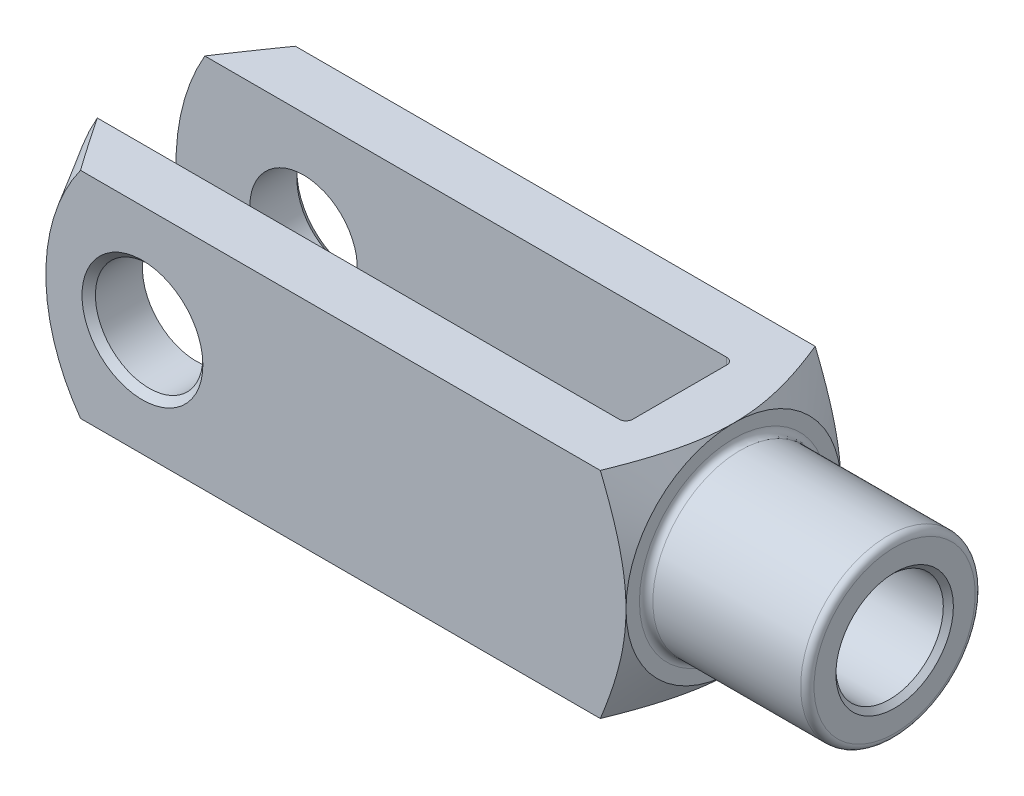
ISO-10303-21;
HEADER;
FILE_DESCRIPTION(('STEP AP214'),'2;1');
FILE_NAME('part.step','',(''),(''),'','','');
FILE_SCHEMA(('AUTOMOTIVE_DESIGN { 1 0 10303 214 1 1 1 1 }'));
ENDSEC;
DATA;
#1=APPLICATION_CONTEXT('core data for automotive mechanical design processes');
#2=APPLICATION_PROTOCOL_DEFINITION('international standard','automotive_design',2000,#1);
#3=PRODUCT_CONTEXT('',#1,'mechanical');
#4=PRODUCT('Part','Part','',(#3));
#5=PRODUCT_RELATED_PRODUCT_CATEGORY('part','',(#4));
#6=PRODUCT_DEFINITION_FORMATION('','',#4);
#7=PRODUCT_DEFINITION_CONTEXT('part definition',#1,'design');
#8=PRODUCT_DEFINITION('design','',#6,#7);
#9=PRODUCT_DEFINITION_SHAPE('','',#8);
#10=(LENGTH_UNIT() NAMED_UNIT(*) SI_UNIT(.MILLI.,.METRE.));
#11=(NAMED_UNIT(*) PLANE_ANGLE_UNIT() SI_UNIT($,.RADIAN.));
#12=(NAMED_UNIT(*) SI_UNIT($,.STERADIAN.) SOLID_ANGLE_UNIT());
#13=UNCERTAINTY_MEASURE_WITH_UNIT(LENGTH_MEASURE(1.E-05),#10,'distance_accuracy_value','');
#14=(GEOMETRIC_REPRESENTATION_CONTEXT(3) GLOBAL_UNCERTAINTY_ASSIGNED_CONTEXT((#13)) GLOBAL_UNIT_ASSIGNED_CONTEXT((#10,
#11,#12)) REPRESENTATION_CONTEXT('',''));
#15=CARTESIAN_POINT('',(0.,0.,0.));
#16=DIRECTION('',(0.,0.,1.));
#17=DIRECTION('',(1.,0.,0.));
#18=AXIS2_PLACEMENT_3D('',#15,#16,#17);
#19=CARTESIAN_POINT('',(-33.,-16.,-7.));
#20=DIRECTION('',(0.,-1.,0.));
#21=DIRECTION('',(0.,0.,-1.));
#22=AXIS2_PLACEMENT_3D('',#19,#20,#21);
#23=CYLINDRICAL_SURFACE('',#22,1.);
#24=DIRECTION('',(0.,1.,0.));
#25=VECTOR('',#24,1.);
#26=CARTESIAN_POINT('',(-32.,-16.,-7.));
#27=LINE('',#26,#25);
#28=CARTESIAN_POINT('',(-32.,-3.87298334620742,-7.));
#29=VERTEX_POINT('',#28);
#30=CARTESIAN_POINT('',(-32.,-16.,-7.));
#31=VERTEX_POINT('',#30);
#32=EDGE_CURVE('E358',#29,#31,#27,.F.);
#33=ORIENTED_EDGE('',*,*,#32,.F.);
#34=CARTESIAN_POINT('',(-32.,-3.87298334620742,-7.));
#35=CARTESIAN_POINT('',(-32.0000090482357,-3.81506111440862,-7.03204875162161));
#36=CARTESIAN_POINT('',(-32.0015394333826,-3.75675902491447,-7.06336585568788));
#37=CARTESIAN_POINT('',(-32.0073016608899,-3.63952511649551,-7.12448038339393));
#38=CARTESIAN_POINT('',(-32.0115323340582,-3.58059358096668,-7.15427845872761));
#39=CARTESIAN_POINT('',(-32.0277410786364,-3.40324230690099,-7.24121872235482));
#40=CARTESIAN_POINT('',(-32.0432390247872,-3.28400247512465,-7.29605254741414));
#41=CARTESIAN_POINT('',(-32.081478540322,-3.04456972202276,-7.39915667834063));
#42=CARTESIAN_POINT('',(-32.1041870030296,-2.92438355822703,-7.44745557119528));
#43=CARTESIAN_POINT('',(-32.1553570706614,-2.68282861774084,-7.53784294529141));
#44=CARTESIAN_POINT('',(-32.1838229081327,-2.5614590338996,-7.57992681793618));
#45=CARTESIAN_POINT('',(-32.26482781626,-2.24038507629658,-7.68273685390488));
#46=CARTESIAN_POINT('',(-32.3211617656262,-2.03996193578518,-7.7382927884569));
#47=CARTESIAN_POINT('',(-32.4418505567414,-1.63779800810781,-7.8332865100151));
#48=CARTESIAN_POINT('',(-32.5062087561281,-1.43605670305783,-7.87271752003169));
#49=CARTESIAN_POINT('',(-32.7067987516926,-0.829293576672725,-7.96742194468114));
#50=CARTESIAN_POINT('',(-32.8505643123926,-0.422667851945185,-7.99912712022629));
#51=CARTESIAN_POINT('',(-32.9960248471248,-0.0112434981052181,-7.99999406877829));
#52=CARTESIAN_POINT('',(-32.9980124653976,-0.00562166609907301,-7.99999999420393));
#53=CARTESIAN_POINT('',(-33.,0.,-8.));
#54=B_SPLINE_CURVE_WITH_KNOTS('',3,(#34,#35,#36,#37,#38,#39,#40,#41,#42,#43,#44,#45,#46,#47,#48,
#49,#50,#51,#52,#53),.UNSPECIFIED.,.F.,.F.,(4,2,2,2,2,2,2,2,2,4),(0.,0.198535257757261,
0.396984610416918,0.792983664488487,1.18719018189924,1.5816875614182,2.22713013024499,
2.87284368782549,4.16406208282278,4.18195063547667),.UNSPECIFIED.);
#55=CARTESIAN_POINT('',(-33.,0.,-8.));
#56=VERTEX_POINT('',#55);
#57=EDGE_CURVE('E391',#29,#56,#54,.T.);
#58=ORIENTED_EDGE('',*,*,#57,.T.);
#59=DIRECTION('',(0.,1.,0.));
#60=VECTOR('',#59,1.);
#61=CARTESIAN_POINT('',(-33.,16.,-8.));
#62=LINE('',#61,#60);
#63=CARTESIAN_POINT('',(-33.,-16.,-8.));
#64=VERTEX_POINT('',#63);
#65=EDGE_CURVE('E183',#64,#56,#62,.T.);
#66=ORIENTED_EDGE('',*,*,#65,.F.);
#67=CARTESIAN_POINT('',(-33.,-16.,-7.));
#68=DIRECTION('',(0.,-1.,0.));
#69=DIRECTION('',(0.,0.,-1.));
#70=AXIS2_PLACEMENT_3D('',#67,#68,#69);
#71=CIRCLE('',#70,1.);
#72=EDGE_CURVE('E198',#31,#64,#71,.F.);
#73=ORIENTED_EDGE('',*,*,#72,.F.);
#74=EDGE_LOOP('',(#33,#58,#66,#73));
#75=FACE_BOUND('',#74,.T.);
#76=ADVANCED_FACE('F37',(#75),#23,.F.);
#77=CARTESIAN_POINT('',(-32.,-16.,-8.));
#78=DIRECTION('',(1.,0.,0.));
#79=DIRECTION('',(0.,0.,-1.));
#80=AXIS2_PLACEMENT_3D('',#77,#78,#79);
#81=PLANE('',#80);
#82=CARTESIAN_POINT('',(-32.,16.,-7.));
#83=VERTEX_POINT('',#82);
#84=CARTESIAN_POINT('',(-32.,3.87298334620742,-7.));
#85=VERTEX_POINT('',#84);
#86=EDGE_CURVE('E374',#83,#85,#27,.F.);
#87=ORIENTED_EDGE('',*,*,#86,.T.);
#88=CARTESIAN_POINT('',(-32.,0.,0.));
#89=DIRECTION('',(1.,0.,0.));
#90=DIRECTION('',(0.,0.,-1.));
#91=AXIS2_PLACEMENT_3D('',#88,#89,#90);
#92=CIRCLE('',#91,8.);
#93=CARTESIAN_POINT('',(-32.,3.87298334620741,7.));
#94=VERTEX_POINT('',#93);
#95=EDGE_CURVE('E745',#85,#94,#92,.T.);
#96=ORIENTED_EDGE('',*,*,#95,.T.);
#97=DIRECTION('',(0.,1.,0.));
#98=VECTOR('',#97,1.);
#99=CARTESIAN_POINT('',(-32.,16.,7.));
#100=LINE('',#99,#98);
#101=CARTESIAN_POINT('',(-32.,16.,7.));
#102=VERTEX_POINT('',#101);
#103=EDGE_CURVE('E160',#94,#102,#100,.T.);
#104=ORIENTED_EDGE('',*,*,#103,.T.);
#105=DIRECTION('',(0.,0.,-1.));
#106=VECTOR('',#105,1.);
#107=CARTESIAN_POINT('',(-32.,16.,-8.));
#108=LINE('',#107,#106);
#109=EDGE_CURVE('E338',#102,#83,#108,.T.);
#110=ORIENTED_EDGE('',*,*,#109,.T.);
#111=EDGE_LOOP('',(#87,#96,#104,#110));
#112=FACE_BOUND('',#111,.T.);
#113=ADVANCED_FACE('F492',(#112),#81,.F.);
#114=CARTESIAN_POINT('',(-33.,-16.,7.));
#115=DIRECTION('',(0.,-1.,0.));
#116=DIRECTION('',(0.,0.,-1.));
#117=AXIS2_PLACEMENT_3D('',#114,#115,#116);
#118=CYLINDRICAL_SURFACE('',#117,1.);
#119=ORIENTED_EDGE('',*,*,#103,.F.);
#120=CARTESIAN_POINT('',(-32.,3.87298334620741,7.));
#121=CARTESIAN_POINT('',(-32.0000090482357,3.8150611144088,7.03204875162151));
#122=CARTESIAN_POINT('',(-32.0015394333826,3.75675902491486,7.06336585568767));
#123=CARTESIAN_POINT('',(-32.0073016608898,3.63952511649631,7.12448038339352));
#124=CARTESIAN_POINT('',(-32.0115323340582,3.58059358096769,7.15427845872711));
#125=CARTESIAN_POINT('',(-32.0277410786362,3.40324230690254,7.24121872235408));
#126=CARTESIAN_POINT('',(-32.043239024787,3.28400247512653,7.29605254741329));
#127=CARTESIAN_POINT('',(-32.0814785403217,3.04456972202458,7.39915667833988));
#128=CARTESIAN_POINT('',(-32.1041870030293,2.92438355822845,7.44745557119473));
#129=CARTESIAN_POINT('',(-32.1553570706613,2.68282861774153,7.53784294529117));
#130=CARTESIAN_POINT('',(-32.1838229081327,2.56145903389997,7.57992681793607));
#131=CARTESIAN_POINT('',(-32.2648278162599,2.24038507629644,7.6827368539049));
#132=CARTESIAN_POINT('',(-32.3211617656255,2.03996193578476,7.73829278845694));
#133=CARTESIAN_POINT('',(-32.4418505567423,1.63779800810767,7.83328651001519));
#134=CARTESIAN_POINT('',(-32.5062087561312,1.43605670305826,7.87271752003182));
#135=CARTESIAN_POINT('',(-32.706798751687,0.829293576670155,7.96742194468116));
#136=CARTESIAN_POINT('',(-32.850564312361,0.422667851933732,7.99912712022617));
#137=CARTESIAN_POINT('',(-32.9960248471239,0.0112434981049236,7.99999406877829));
#138=CARTESIAN_POINT('',(-32.9980124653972,0.00562166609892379,7.99999999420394));
#139=CARTESIAN_POINT('',(-33.,0.,8.));
#140=B_SPLINE_CURVE_WITH_KNOTS('',3,(#120,#121,#122,#123,#124,#125,#126,#127,#128,#129,#130,
#131,#132,#133,#134,#135,#136,#137,#138,#139),.UNSPECIFIED.,.F.,.F.,(4,2,2,2,2,2,2,2,2,4),(0.,
0.198535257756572,0.396984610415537,0.792983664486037,1.18719018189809,1.5816875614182,
2.22713013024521,2.87284368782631,4.16406208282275,4.18195063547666),.UNSPECIFIED.);
#141=CARTESIAN_POINT('',(-33.,0.,8.));
#142=VERTEX_POINT('',#141);
#143=EDGE_CURVE('E145',#94,#142,#140,.T.);
#144=ORIENTED_EDGE('',*,*,#143,.T.);
#145=DIRECTION('',(0.,1.,0.));
#146=VECTOR('',#145,1.);
#147=CARTESIAN_POINT('',(-33.,-16.,8.));
#148=LINE('',#147,#146);
#149=CARTESIAN_POINT('',(-33.,16.,8.));
#150=VERTEX_POINT('',#149);
#151=EDGE_CURVE('E159',#150,#142,#148,.F.);
#152=ORIENTED_EDGE('',*,*,#151,.F.);
#153=CARTESIAN_POINT('',(-33.,16.,7.));
#154=DIRECTION('',(0.,1.,0.));
#155=DIRECTION('',(0.,0.,1.));
#156=AXIS2_PLACEMENT_3D('',#153,#154,#155);
#157=CIRCLE('',#156,1.);
#158=EDGE_CURVE('E190',#102,#150,#157,.F.);
#159=ORIENTED_EDGE('',*,*,#158,.F.);
#160=EDGE_LOOP('',(#119,#144,#152,#159));
#161=FACE_BOUND('',#160,.T.);
#162=ADVANCED_FACE('F156',(#161),#118,.F.);
#163=CARTESIAN_POINT('',(-115.,-16.,-7.99999999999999));
#164=DIRECTION('',(0.,0.,-1.));
#165=DIRECTION('',(-1.,0.,0.));
#166=AXIS2_PLACEMENT_3D('',#163,#164,#165);
#167=PLANE('',#166);
#168=CARTESIAN_POINT('',(-96.,0.,-7.99999999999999));
#169=DIRECTION('',(0.,0.,-1.));
#170=DIRECTION('',(-1.,0.,0.));
#171=AXIS2_PLACEMENT_3D('',#168,#169,#170);
#172=CIRCLE('',#171,8.);
#173=CARTESIAN_POINT('',(-104.,0.,-7.99999999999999));
#174=VERTEX_POINT('',#173);
#175=EDGE_CURVE('E368',#174,#174,#172,.F.);
#176=ORIENTED_EDGE('',*,*,#175,.F.);
#177=EDGE_LOOP('',(#176));
#178=FACE_BOUND('',#177,.T.);
#179=CARTESIAN_POINT('',(-83.,0.,-7.99999999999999));
#180=DIRECTION('',(0.,0.,1.));
#181=DIRECTION('',(1.,0.,0.));
#182=AXIS2_PLACEMENT_3D('',#179,#180,#181);
#183=CIRCLE('',#182,32.);
#184=CARTESIAN_POINT('',(-110.712812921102,16.,-7.99999999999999));
#185=VERTEX_POINT('',#184);
#186=CARTESIAN_POINT('',(-110.712812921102,-16.,-7.99999999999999));
#187=VERTEX_POINT('',#186);
#188=EDGE_CURVE('E277',#185,#187,#183,.T.);
#189=ORIENTED_EDGE('',*,*,#188,.T.);
#190=DIRECTION('',(-1.,0.,0.));
#191=VECTOR('',#190,1.);
#192=CARTESIAN_POINT('',(-115.,-16.,-7.99999999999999));
#193=LINE('',#192,#191);
#194=EDGE_CURVE('E333',#64,#187,#193,.T.);
#195=ORIENTED_EDGE('',*,*,#194,.F.);
#196=ORIENTED_EDGE('',*,*,#65,.T.);
#197=CARTESIAN_POINT('',(-33.,16.,-8.));
#198=VERTEX_POINT('',#197);
#199=EDGE_CURVE('E179',#56,#198,#62,.T.);
#200=ORIENTED_EDGE('',*,*,#199,.T.);
#201=DIRECTION('',(-1.,0.,0.));
#202=VECTOR('',#201,1.);
#203=CARTESIAN_POINT('',(-115.,16.,-7.99999999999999));
#204=LINE('',#203,#202);
#205=EDGE_CURVE('E346',#198,#185,#204,.T.);
#206=ORIENTED_EDGE('',*,*,#205,.T.);
#207=EDGE_LOOP('',(#189,#195,#196,#200,#206));
#208=FACE_BOUND('',#207,.T.);
#209=ADVANCED_FACE('F394',(#178,#208),#167,.F.);
#210=CARTESIAN_POINT('',(-115.,-16.,8.00000000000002));
#211=DIRECTION('',(0.,0.,1.));
#212=DIRECTION('',(1.,0.,0.));
#213=AXIS2_PLACEMENT_3D('',#210,#211,#212);
#214=PLANE('',#213);
#215=CARTESIAN_POINT('',(-96.,0.,8.00000000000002));
#216=DIRECTION('',(0.,0.,1.));
#217=DIRECTION('',(1.,0.,0.));
#218=AXIS2_PLACEMENT_3D('',#215,#216,#217);
#219=CIRCLE('',#218,8.);
#220=CARTESIAN_POINT('',(-88.,0.,8.00000000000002));
#221=VERTEX_POINT('',#220);
#222=EDGE_CURVE('E345',#221,#221,#219,.F.);
#223=ORIENTED_EDGE('',*,*,#222,.F.);
#224=EDGE_LOOP('',(#223));
#225=FACE_BOUND('',#224,.T.);
#226=DIRECTION('',(1.,0.,0.));
#227=VECTOR('',#226,1.);
#228=CARTESIAN_POINT('',(-115.,-16.,8.00000000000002));
#229=LINE('',#228,#227);
#230=CARTESIAN_POINT('',(-110.712812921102,-16.,8.00000000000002));
#231=VERTEX_POINT('',#230);
#232=CARTESIAN_POINT('',(-33.,-16.,8.));
#233=VERTEX_POINT('',#232);
#234=EDGE_CURVE('E337',#231,#233,#229,.T.);
#235=ORIENTED_EDGE('',*,*,#234,.F.);
#236=CARTESIAN_POINT('',(-83.,0.,8.00000000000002));
#237=DIRECTION('',(0.,0.,1.));
#238=DIRECTION('',(1.,0.,0.));
#239=AXIS2_PLACEMENT_3D('',#236,#237,#238);
#240=CIRCLE('',#239,32.);
#241=CARTESIAN_POINT('',(-110.712812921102,16.,8.00000000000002));
#242=VERTEX_POINT('',#241);
#243=EDGE_CURVE('E414',#242,#231,#240,.T.);
#244=ORIENTED_EDGE('',*,*,#243,.F.);
#245=DIRECTION('',(1.,0.,0.));
#246=VECTOR('',#245,1.);
#247=CARTESIAN_POINT('',(-115.,16.,8.00000000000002));
#248=LINE('',#247,#246);
#249=EDGE_CURVE('E176',#242,#150,#248,.T.);
#250=ORIENTED_EDGE('',*,*,#249,.T.);
#251=ORIENTED_EDGE('',*,*,#151,.T.);
#252=EDGE_CURVE('E164',#142,#233,#148,.F.);
#253=ORIENTED_EDGE('',*,*,#252,.T.);
#254=EDGE_LOOP('',(#235,#244,#250,#251,#253));
#255=FACE_BOUND('',#254,.T.);
#256=ADVANCED_FACE('F173',(#225,#255),#214,.F.);
#257=CARTESIAN_POINT('',(-115.,-16.,16.));
#258=DIRECTION('',(0.,0.,1.));
#259=DIRECTION('',(1.,0.,0.));
#260=AXIS2_PLACEMENT_3D('',#257,#258,#259);
#261=PLANE('',#260);
#262=CARTESIAN_POINT('',(-96.,0.,16.));
#263=DIRECTION('',(0.,0.,1.));
#264=DIRECTION('',(1.,0.,0.));
#265=AXIS2_PLACEMENT_3D('',#262,#263,#264);
#266=CIRCLE('',#265,8.99999999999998);
#267=CARTESIAN_POINT('',(-87.,0.,16.));
#268=VERTEX_POINT('',#267);
#269=EDGE_CURVE('E229',#268,#268,#266,.F.);
#270=ORIENTED_EDGE('',*,*,#269,.T.);
#271=EDGE_LOOP('',(#270));
#272=FACE_BOUND('',#271,.T.);
#273=DIRECTION('',(1.,0.,0.));
#274=VECTOR('',#273,1.);
#275=CARTESIAN_POINT('',(-115.,16.,16.));
#276=LINE('',#275,#274);
#277=CARTESIAN_POINT('',(-105.220035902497,16.,16.));
#278=VERTEX_POINT('',#277);
#279=CARTESIAN_POINT('',(-27.8263409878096,16.,16.));
#280=VERTEX_POINT('',#279);
#281=EDGE_CURVE('E365',#278,#280,#276,.T.);
#282=ORIENTED_EDGE('',*,*,#281,.F.);
#283=CARTESIAN_POINT('',(-83.,0.,16.));
#284=DIRECTION('',(0.,0.,1.));
#285=DIRECTION('',(1.,0.,0.));
#286=AXIS2_PLACEMENT_3D('',#283,#284,#285);
#287=CIRCLE('',#286,27.3811978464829);
#288=CARTESIAN_POINT('',(-105.220035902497,-16.,16.));
#289=VERTEX_POINT('',#288);
#290=EDGE_CURVE('E61',#278,#289,#287,.T.);
#291=ORIENTED_EDGE('',*,*,#290,.T.);
#292=DIRECTION('',(1.,0.,0.));
#293=VECTOR('',#292,1.);
#294=CARTESIAN_POINT('',(-115.,-16.,16.));
#295=LINE('',#294,#293);
#296=CARTESIAN_POINT('',(-27.8263409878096,-16.,16.));
#297=VERTEX_POINT('',#296);
#298=EDGE_CURVE('E362',#289,#297,#295,.T.);
#299=ORIENTED_EDGE('',*,*,#298,.T.);
#300=CARTESIAN_POINT('',(-35.7693975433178,-32.6784696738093,16.));
#301=CARTESIAN_POINT('',(-35.5649534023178,-32.2841914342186,16.));
#302=CARTESIAN_POINT('',(-35.3610695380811,-31.8896227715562,16.));
#303=CARTESIAN_POINT('',(-34.9545422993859,-31.0998453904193,16.));
#304=CARTESIAN_POINT('',(-34.7518989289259,-30.7046366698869,16.));
#305=CARTESIAN_POINT('',(-34.1459910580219,-29.5179255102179,16.));
#306=CARTESIAN_POINT('',(-33.7447694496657,-28.725377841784,16.));
#307=CARTESIAN_POINT('',(-32.948304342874,-27.1355535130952,16.));
#308=CARTESIAN_POINT('',(-32.5530724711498,-26.3382710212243,16.));
#309=CARTESIAN_POINT('',(-31.7709229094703,-24.7396478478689,16.));
#310=CARTESIAN_POINT('',(-31.384005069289,-23.9383072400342,16.));
#311=CARTESIAN_POINT('',(-30.5971278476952,-22.2812030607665,16.));
#312=CARTESIAN_POINT('',(-30.1978306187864,-21.4251243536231,16.));
#313=CARTESIAN_POINT('',(-29.4144189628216,-19.7059517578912,16.));
#314=CARTESIAN_POINT('',(-29.0303053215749,-18.8428575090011,16.));
#315=CARTESIAN_POINT('',(-28.469277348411,-17.5419055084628,16.));
#316=CARTESIAN_POINT('',(-28.2848287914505,-17.1072946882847,16.));
#317=CARTESIAN_POINT('',(-27.9217435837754,-16.2356552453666,16.));
#318=CARTESIAN_POINT('',(-27.7431068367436,-15.7986266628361,16.));
#319=CARTESIAN_POINT('',(-27.3925648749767,-14.9219132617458,16.));
#320=CARTESIAN_POINT('',(-27.2206591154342,-14.4822286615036,16.));
#321=CARTESIAN_POINT('',(-26.8846508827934,-13.5998952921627,16.));
#322=CARTESIAN_POINT('',(-26.7205482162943,-13.15724659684,16.));
#323=CARTESIAN_POINT('',(-26.3667959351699,-12.1723292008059,16.));
#324=CARTESIAN_POINT('',(-26.1793236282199,-11.6292738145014,16.));
#325=CARTESIAN_POINT('',(-25.8205117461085,-10.5378822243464,16.));
#326=CARTESIAN_POINT('',(-25.6491707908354,-9.98954647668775,16.));
#327=CARTESIAN_POINT('',(-25.3258019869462,-8.8871811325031,16.));
#328=CARTESIAN_POINT('',(-25.1737737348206,-8.33315165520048,16.));
#329=CARTESIAN_POINT('',(-24.892661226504,-7.21925530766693,16.));
#330=CARTESIAN_POINT('',(-24.763576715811,-6.65938850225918,16.));
#331=CARTESIAN_POINT('',(-24.5349588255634,-5.54729135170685,16.));
#332=CARTESIAN_POINT('',(-24.4348028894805,-4.99519025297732,16.));
#333=CARTESIAN_POINT('',(-24.2636126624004,-3.88645323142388,16.));
#334=CARTESIAN_POINT('',(-24.1925774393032,-3.32981745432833,16.));
#335=CARTESIAN_POINT('',(-24.0825979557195,-2.21371046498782,16.));
#336=CARTESIAN_POINT('',(-24.0436327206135,-1.65424134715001,16.));
#337=CARTESIAN_POINT('',(-23.9995121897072,-0.533966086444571,16.));
#338=CARTESIAN_POINT('',(-23.9943557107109,0.0268400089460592,16.));
#339=CARTESIAN_POINT('',(-24.0172205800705,1.10686412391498,16.));
#340=CARTESIAN_POINT('',(-24.0428517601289,1.62613491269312,16.));
#341=CARTESIAN_POINT('',(-24.1223285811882,2.66248971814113,16.));
#342=CARTESIAN_POINT('',(-24.1761741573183,3.17957373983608,16.));
#343=CARTESIAN_POINT('',(-24.3101058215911,4.21056490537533,16.));
#344=CARTESIAN_POINT('',(-24.3902054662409,4.72447026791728,16.));
#345=CARTESIAN_POINT('',(-24.5740043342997,5.74801582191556,16.));
#346=CARTESIAN_POINT('',(-24.6777042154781,6.25765589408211,16.));
#347=CARTESIAN_POINT('',(-24.909120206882,7.2869259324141,16.));
#348=CARTESIAN_POINT('',(-25.0374445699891,7.80641809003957,16.));
#349=CARTESIAN_POINT('',(-25.3129308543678,8.8403489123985,16.));
#350=CARTESIAN_POINT('',(-25.4600929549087,9.3547875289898,16.));
#351=CARTESIAN_POINT('',(-25.7704071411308,10.3787720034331,16.));
#352=CARTESIAN_POINT('',(-25.9335585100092,10.8883180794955,16.));
#353=CARTESIAN_POINT('',(-26.1884088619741,11.6492037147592,16.));
#354=CARTESIAN_POINT('',(-26.2750447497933,11.9022560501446,16.));
#355=CARTESIAN_POINT('',(-26.4514227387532,12.4072754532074,16.));
#356=CARTESIAN_POINT('',(-26.5411648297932,12.6592425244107,16.));
#357=CARTESIAN_POINT('',(-26.8295171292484,13.454575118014,16.));
#358=CARTESIAN_POINT('',(-27.0333628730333,13.9960468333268,16.));
#359=CARTESIAN_POINT('',(-27.4521222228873,15.0747063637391,16.));
#360=CARTESIAN_POINT('',(-27.6670364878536,15.6118939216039,16.));
#361=CARTESIAN_POINT('',(-28.1061456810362,16.6825956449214,16.));
#362=CARTESIAN_POINT('',(-28.3303426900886,17.2161089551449,16.));
#363=CARTESIAN_POINT('',(-28.786473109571,18.2797983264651,16.));
#364=CARTESIAN_POINT('',(-29.0184063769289,18.8099744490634,16.));
#365=CARTESIAN_POINT('',(-29.4890009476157,19.8678755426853,16.));
#366=CARTESIAN_POINT('',(-29.727667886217,20.3955980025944,16.));
#367=CARTESIAN_POINT('',(-30.2105443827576,21.448499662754,16.));
#368=CARTESIAN_POINT('',(-30.4547539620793,21.9736788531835,16.));
#369=CARTESIAN_POINT('',(-30.9478700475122,23.0217502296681,16.));
#370=CARTESIAN_POINT('',(-31.1967760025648,23.5446426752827,16.));
#371=CARTESIAN_POINT('',(-31.6986473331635,24.588477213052,16.));
#372=CARTESIAN_POINT('',(-31.9516127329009,25.1094192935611,16.));
#373=CARTESIAN_POINT('',(-32.71728755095,26.6728451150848,16.));
#374=CARTESIAN_POINT('',(-33.2352702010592,27.7127471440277,16.));
#375=CARTESIAN_POINT('',(-34.2818275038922,29.7872182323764,16.));
#376=CARTESIAN_POINT('',(-34.8104023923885,30.8217871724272,16.));
#377=CARTESIAN_POINT('',(-35.8754784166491,32.8861860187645,16.));
#378=CARTESIAN_POINT('',(-36.4119755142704,33.9160180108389,16.));
#379=CARTESIAN_POINT('',(-37.4913991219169,35.9722925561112,16.));
#380=CARTESIAN_POINT('',(-38.0343255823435,36.9987351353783,16.));
#381=CARTESIAN_POINT('',(-39.0443143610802,38.89664731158,16.));
#382=CARTESIAN_POINT('',(-39.5106690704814,39.7684938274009,16.));
#383=CARTESIAN_POINT('',(-40.446506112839,41.5105071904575,16.));
#384=CARTESIAN_POINT('',(-40.9159884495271,42.3806740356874,16.));
#385=CARTESIAN_POINT('',(-42.3285002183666,44.9892873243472,16.));
#386=CARTESIAN_POINT('',(-43.2754644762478,46.725603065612,16.));
#387=CARTESIAN_POINT('',(-45.1715733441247,50.1841146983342,16.));
#388=CARTESIAN_POINT('',(-46.120674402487,51.9063345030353,16.));
#389=CARTESIAN_POINT('',(-47.5485244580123,54.4871624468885,16.));
#390=CARTESIAN_POINT('',(-48.0251365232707,55.346953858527,16.));
#391=CARTESIAN_POINT('',(-48.9796167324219,57.0658379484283,16.));
#392=CARTESIAN_POINT('',(-49.4574848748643,57.9249306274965,16.));
#393=CARTESIAN_POINT('',(-49.9358976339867,58.7837198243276,16.));
#394=B_SPLINE_CURVE_WITH_KNOTS('',3,(#300,#301,#302,#303,#304,#305,#306,#307,#308,#309,#310,
#311,#312,#313,#314,#315,#316,#317,#318,#319,#320,#321,#322,#323,#324,#325,#326,#327,#328,#329,
#330,#331,#332,#333,#334,#335,#336,#337,#338,#339,#340,#341,#342,#343,#344,#345,#346,#347,#348,
#349,#350,#351,#352,#353,#354,#355,#356,#357,#358,#359,#360,#361,#362,#363,#364,#365,#366,#367,
#368,#369,#370,#371,#372,#373,#374,#375,#376,#377,#378,#379,#380,#381,#382,#383,#384,#385,#386,
#387,#388,#389,#390,#391,#392,#393),.UNSPECIFIED.,.F.,.F.,(4,2,2,2,2,2,2,2,2,2,2,2,2,2,2,2,2,2,
2,2,2,2,2,2,2,2,2,2,2,2,2,2,2,2,2,2,2,2,2,2,2,2,2,2,2,2,4),(0.,1.33239347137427,
2.66479123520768,5.32972119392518,7.99929176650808,10.6688140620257,13.5025727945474,
16.3364779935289,17.7528378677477,19.1691742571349,20.5853957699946,22.0015821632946,
23.7248813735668,25.4480330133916,27.1711486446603,28.8942451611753,30.5768935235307,
32.2594880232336,33.9409811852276,35.6224155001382,37.1813298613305,38.7402406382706,
40.2999576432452,41.8597181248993,43.4646245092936,45.0695461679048,46.6743959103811,
47.4767954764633,48.2791924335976,50.0147426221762,51.7503962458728,53.4864410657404,
55.2224537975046,56.95996517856,58.6974832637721,60.4347987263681,62.172124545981,
65.6573336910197,69.142620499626,72.6261882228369,76.1097290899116,79.0759362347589,
82.0421469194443,87.9753961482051,93.8746630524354,96.8238320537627,99.7729976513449),.UNSPECIFIED.);
#395=CARTESIAN_POINT('',(-24.,0.,16.));
#396=VERTEX_POINT('',#395);
#397=EDGE_CURVE('E305',#396,#297,#394,.F.);
#398=ORIENTED_EDGE('',*,*,#397,.F.);
#399=EDGE_CURVE('E303',#280,#396,#394,.F.);
#400=ORIENTED_EDGE('',*,*,#399,.F.);
#401=EDGE_LOOP('',(#282,#291,#299,#398,#400));
#402=FACE_BOUND('',#401,.T.);
#403=ADVANCED_FACE('F288',(#272,#402),#261,.T.);
#404=CARTESIAN_POINT('',(-115.,-16.,16.));
#405=DIRECTION('',(0.,-1.,0.));
#406=DIRECTION('',(0.,0.,-1.));
#407=AXIS2_PLACEMENT_3D('',#404,#405,#406);
#408=PLANE('',#407);
#409=ORIENTED_EDGE('',*,*,#194,.T.);
#410=CARTESIAN_POINT('',(-123.371429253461,-16.,11.7911070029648));
#411=CARTESIAN_POINT('',(-122.592945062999,-16.,10.5376757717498));
#412=CARTESIAN_POINT('',(-121.81232808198,-16.,9.28556385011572));
#413=CARTESIAN_POINT('',(-120.245832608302,-16.,6.784601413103));
#414=CARTESIAN_POINT('',(-119.459954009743,-16.,5.53575096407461));
#415=CARTESIAN_POINT('',(-117.881028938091,-16.,3.04049656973));
#416=CARTESIAN_POINT('',(-117.087975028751,-16.,1.79409732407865));
#417=CARTESIAN_POINT('',(-115.892706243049,-16.,-0.0718476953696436));
#418=CARTESIAN_POINT('',(-115.493337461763,-16.,-0.693217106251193));
#419=CARTESIAN_POINT('',(-114.692490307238,-16.,-1.93460096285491));
#420=CARTESIAN_POINT('',(-114.291011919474,-16.,-2.55461539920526));
#421=CARTESIAN_POINT('',(-113.049557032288,-16.,-4.46394316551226));
#422=CARTESIAN_POINT('',(-112.205685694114,-16.,-5.75072871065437));
#423=CARTESIAN_POINT('',(-110.505216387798,-16.,-8.31586424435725));
#424=CARTESIAN_POINT('',(-109.64861856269,-16.,-9.59421432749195));
#425=CARTESIAN_POINT('',(-108.351696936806,-16.,-11.5028868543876));
#426=CARTESIAN_POINT('',(-107.917546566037,-16.,-12.1374051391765));
#427=CARTESIAN_POINT('',(-107.04451814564,-16.,-13.4031790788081));
#428=CARTESIAN_POINT('',(-106.605640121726,-16.,-14.0344347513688));
#429=CARTESIAN_POINT('',(-105.722450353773,-16.,-15.2930972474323));
#430=CARTESIAN_POINT('',(-105.278138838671,-16.,-15.9205042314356));
#431=CARTESIAN_POINT('',(-104.383178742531,-16.,-17.1707775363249));
#432=CARTESIAN_POINT('',(-103.932530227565,-16.,-17.7936439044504));
#433=CARTESIAN_POINT('',(-103.028029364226,-16.,-19.0281553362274));
#434=CARTESIAN_POINT('',(-102.574246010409,-16.,-19.6398508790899));
#435=CARTESIAN_POINT('',(-101.658039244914,-16.,-20.8567662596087));
#436=CARTESIAN_POINT('',(-101.195615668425,-16.,-21.4619859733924));
#437=CARTESIAN_POINT('',(-100.259814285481,-16.,-22.6652514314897));
#438=CARTESIAN_POINT('',(-99.7864223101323,-16.,-23.2632861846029));
#439=CARTESIAN_POINT('',(-98.8271654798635,-16.,-24.4492371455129));
#440=CARTESIAN_POINT('',(-98.3413013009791,-16.,-25.0371538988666));
#441=CARTESIAN_POINT('',(-97.3593848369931,-16.,-26.1940459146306));
#442=CARTESIAN_POINT('',(-96.8634904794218,-16.,-26.7631543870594));
#443=CARTESIAN_POINT('',(-96.1056619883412,-16.,-27.6043633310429));
#444=CARTESIAN_POINT('',(-95.8506801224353,-16.,-27.8827334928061));
#445=CARTESIAN_POINT('',(-95.3355101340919,-16.,-28.434607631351));
#446=CARTESIAN_POINT('',(-95.0753221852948,-16.,-28.7081117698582));
#447=CARTESIAN_POINT('',(-94.5496746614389,-16.,-29.2488627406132));
#448=CARTESIAN_POINT('',(-94.2842277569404,-16.,-29.5161218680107));
#449=CARTESIAN_POINT('',(-93.7468052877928,-16.,-30.0439769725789));
#450=CARTESIAN_POINT('',(-93.474830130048,-16.,-30.3045733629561));
#451=CARTESIAN_POINT('',(-92.9236476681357,-16.,-30.8177372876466));
#452=CARTESIAN_POINT('',(-92.6444440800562,-16.,-31.0703088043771));
#453=CARTESIAN_POINT('',(-92.0777664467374,-16.,-31.5659640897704));
#454=CARTESIAN_POINT('',(-91.7902936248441,-16.,-31.8090492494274));
#455=CARTESIAN_POINT('',(-91.3468920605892,-16.,-32.1692925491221));
#456=CARTESIAN_POINT('',(-91.19437175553,-16.,-32.2906537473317));
#457=CARTESIAN_POINT('',(-90.8866765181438,-16.,-32.5299575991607));
#458=CARTESIAN_POINT('',(-90.731501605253,-16.,-32.6479002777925));
#459=CARTESIAN_POINT('',(-90.261690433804,-16.,-32.9961048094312));
#460=CARTESIAN_POINT('',(-89.9428096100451,-16.,-33.2207088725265));
#461=CARTESIAN_POINT('',(-89.2928256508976,-16.,-33.6509952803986));
#462=CARTESIAN_POINT('',(-88.9617323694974,-16.,-33.8566924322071));
#463=CARTESIAN_POINT('',(-88.286089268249,-16.,-34.2447467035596));
#464=CARTESIAN_POINT('',(-87.9415429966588,-16.,-34.427109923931));
#465=CARTESIAN_POINT('',(-87.318754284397,-16.,-34.7245627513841));
#466=CARTESIAN_POINT('',(-87.0433165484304,-16.,-34.8455088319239));
#467=CARTESIAN_POINT('',(-86.4844448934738,-16.,-35.0671656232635));
#468=CARTESIAN_POINT('',(-86.2010136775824,-16.,-35.1678830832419));
#469=CARTESIAN_POINT('',(-85.6272287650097,-16.,-35.3459456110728));
#470=CARTESIAN_POINT('',(-85.3368843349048,-16.,-35.4233202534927));
#471=CARTESIAN_POINT('',(-84.7504269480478,-16.,-35.5520122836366));
#472=CARTESIAN_POINT('',(-84.4543142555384,-16.,-35.6033308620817));
#473=CARTESIAN_POINT('',(-83.8555360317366,-16.,-35.6780890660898));
#474=CARTESIAN_POINT('',(-83.5528345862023,-16.,-35.7012449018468));
#475=CARTESIAN_POINT('',(-82.9466256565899,-16.,-35.7176301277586));
#476=CARTESIAN_POINT('',(-82.643118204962,-16.,-35.7108607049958));
#477=CARTESIAN_POINT('',(-82.03817775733,-16.,-35.66772256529));
#478=CARTESIAN_POINT('',(-81.7367451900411,-16.,-35.6313479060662));
#479=CARTESIAN_POINT('',(-81.1385996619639,-16.,-35.5306731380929));
#480=CARTESIAN_POINT('',(-80.8418874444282,-16.,-35.4663686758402));
#481=CARTESIAN_POINT('',(-80.2008177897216,-16.,-35.2982030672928));
#482=CARTESIAN_POINT('',(-79.857810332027,-16.,-35.1892223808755));
#483=CARTESIAN_POINT('',(-79.1829198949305,-16.,-34.9408312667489));
#484=CARTESIAN_POINT('',(-78.8510432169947,-16.,-34.8014039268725));
#485=CARTESIAN_POINT('',(-78.3616955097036,-16.,-34.5731174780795));
#486=CARTESIAN_POINT('',(-78.1997313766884,-16.,-34.4936845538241));
#487=CARTESIAN_POINT('',(-77.8788299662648,-16.,-34.3290841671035));
#488=CARTESIAN_POINT('',(-77.7198913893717,-16.,-34.2439192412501));
#489=CARTESIAN_POINT('',(-77.2474402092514,-16.,-33.9806107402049));
#490=CARTESIAN_POINT('',(-76.9382745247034,-16.,-33.7946450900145));
#491=CARTESIAN_POINT('',(-76.2312746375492,-16.,-33.3419896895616));
#492=CARTESIAN_POINT('',(-75.8376126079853,-16.,-33.0688272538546));
#493=CARTESIAN_POINT('',(-75.0671777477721,-16.,-32.4995062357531));
#494=CARTESIAN_POINT('',(-74.6904130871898,-16.,-32.2033367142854));
#495=CARTESIAN_POINT('',(-73.9509392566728,-16.,-31.5926380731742));
#496=CARTESIAN_POINT('',(-73.588258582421,-16.,-31.2780746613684));
#497=CARTESIAN_POINT('',(-72.8756929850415,-16.,-30.6349635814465));
#498=CARTESIAN_POINT('',(-72.5258059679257,-16.,-30.3064182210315));
#499=CARTESIAN_POINT('',(-71.8346538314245,-16.,-29.6358722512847));
#500=CARTESIAN_POINT('',(-71.4934620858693,-16.,-29.2937963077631));
#501=CARTESIAN_POINT('',(-70.8205894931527,-16.,-28.6004219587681));
#502=CARTESIAN_POINT('',(-70.4889089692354,-16.,-28.2491232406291));
#503=CARTESIAN_POINT('',(-69.8341115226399,-16.,-27.5393264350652));
#504=CARTESIAN_POINT('',(-69.5109860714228,-16.,-27.1808361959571));
#505=CARTESIAN_POINT('',(-68.8718712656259,-16.,-26.4575770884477));
#506=CARTESIAN_POINT('',(-68.5558817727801,-16.,-26.0928083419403));
#507=CARTESIAN_POINT('',(-67.8004695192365,-16.,-25.2057450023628));
#508=CARTESIAN_POINT('',(-67.3641536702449,-16.,-24.6808057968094));
#509=CARTESIAN_POINT('',(-66.5017899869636,-16.,-23.6224177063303));
#510=CARTESIAN_POINT('',(-66.0757441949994,-16.,-23.0889671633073));
#511=CARTESIAN_POINT('',(-65.2388292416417,-16.,-22.0234541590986));
#512=CARTESIAN_POINT('',(-64.8278275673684,-16.,-21.4914956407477));
#513=CARTESIAN_POINT('',(-64.2167920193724,-16.,-20.6895302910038));
#514=CARTESIAN_POINT('',(-64.0140541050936,-16.,-20.4215769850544));
#515=CARTESIAN_POINT('',(-63.6102515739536,-16.,-19.8844163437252));
#516=CARTESIAN_POINT('',(-63.4091869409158,-16.,-19.6152090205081));
#517=CARTESIAN_POINT('',(-63.2088929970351,-16.,-19.3454290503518));
#518=B_SPLINE_CURVE_WITH_KNOTS('',3,(#410,#411,#412,#413,#414,#415,#416,#417,#418,#419,#420,
#421,#422,#423,#424,#425,#426,#427,#428,#429,#430,#431,#432,#433,#434,#435,#436,#437,#438,#439,
#440,#441,#442,#443,#444,#445,#446,#447,#448,#449,#450,#451,#452,#453,#454,#455,#456,#457,#458,
#459,#460,#461,#462,#463,#464,#465,#466,#467,#468,#469,#470,#471,#472,#473,#474,#475,#476,#477,
#478,#479,#480,#481,#482,#483,#484,#485,#486,#487,#488,#489,#490,#491,#492,#493,#494,#495,#496,
#497,#498,#499,#500,#501,#502,#503,#504,#505,#506,#507,#508,#509,#510,#511,#512,#513,#514,#515,
#516,#517),.UNSPECIFIED.,.F.,.F.,(4,2,2,2,2,2,2,2,2,2,2,2,2,2,2,2,2,2,2,2,2,2,2,2,2,2,2,2,2,2,2,
2,2,2,2,2,2,2,2,2,2,2,2,2,2,2,2,2,2,2,2,2,2,4),(0.,4.42653200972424,8.85315338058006,
13.2850586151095,15.5009877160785,17.7169320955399,22.33330454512,26.9496251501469,
29.2560988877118,31.5625600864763,33.8689244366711,36.1752647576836,38.4601118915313,
40.7450026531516,43.0330306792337,45.3209349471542,47.5851104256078,48.7175544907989,
49.8499608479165,50.9799088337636,52.1097865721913,53.2390945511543,54.3682363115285,
54.9529313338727,55.5376220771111,56.7071657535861,57.8757855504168,59.0440991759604,
59.9458947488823,60.8473889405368,61.7477361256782,62.6480421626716,63.5573471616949,
64.4666160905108,65.376067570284,66.2856608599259,67.3636659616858,68.4422713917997,
68.983357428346,69.5242055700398,70.605843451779,72.0422032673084,73.4792502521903,
74.9190675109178,76.3586480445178,77.8078630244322,79.2571271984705,80.704887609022,
82.152619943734,84.2002258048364,86.2482355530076,88.2648689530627,89.2728889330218,
90.2808991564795),.UNSPECIFIED.);
#519=CARTESIAN_POINT('',(-105.220035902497,-16.,-16.));
#520=VERTEX_POINT('',#519);
#521=EDGE_CURVE('E276',#187,#520,#518,.T.);
#522=ORIENTED_EDGE('',*,*,#521,.T.);
#523=DIRECTION('',(1.,0.,0.));
#524=VECTOR('',#523,1.);
#525=CARTESIAN_POINT('',(-115.,-16.,-16.));
#526=LINE('',#525,#524);
#527=CARTESIAN_POINT('',(-27.8263409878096,-16.,-16.));
#528=VERTEX_POINT('',#527);
#529=EDGE_CURVE('E359',#520,#528,#526,.T.);
#530=ORIENTED_EDGE('',*,*,#529,.T.);
#531=CARTESIAN_POINT('',(-35.7693975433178,-16.,-32.6784696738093));
#532=CARTESIAN_POINT('',(-35.5649534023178,-16.,-32.2841914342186));
#533=CARTESIAN_POINT('',(-35.3610695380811,-16.,-31.8896227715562));
#534=CARTESIAN_POINT('',(-34.9545422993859,-16.,-31.0998453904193));
#535=CARTESIAN_POINT('',(-34.7518989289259,-16.,-30.7046366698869));
#536=CARTESIAN_POINT('',(-34.1459910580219,-16.,-29.5179255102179));
#537=CARTESIAN_POINT('',(-33.7447694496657,-16.,-28.725377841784));
#538=CARTESIAN_POINT('',(-32.948304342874,-16.,-27.1355535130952));
#539=CARTESIAN_POINT('',(-32.5530724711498,-16.,-26.3382710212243));
#540=CARTESIAN_POINT('',(-31.7709229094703,-16.,-24.7396478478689));
#541=CARTESIAN_POINT('',(-31.384005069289,-16.,-23.9383072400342));
#542=CARTESIAN_POINT('',(-30.5971278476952,-16.,-22.2812030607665));
#543=CARTESIAN_POINT('',(-30.1978306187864,-16.,-21.4251243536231));
#544=CARTESIAN_POINT('',(-29.4144189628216,-16.,-19.7059517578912));
#545=CARTESIAN_POINT('',(-29.0303053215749,-16.,-18.8428575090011));
#546=CARTESIAN_POINT('',(-28.469277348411,-16.,-17.5419055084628));
#547=CARTESIAN_POINT('',(-28.2848287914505,-16.,-17.1072946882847));
#548=CARTESIAN_POINT('',(-27.9217435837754,-16.,-16.2356552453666));
#549=CARTESIAN_POINT('',(-27.7431068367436,-16.,-15.7986266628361));
#550=CARTESIAN_POINT('',(-27.3925648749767,-16.,-14.9219132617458));
#551=CARTESIAN_POINT('',(-27.2206591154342,-16.,-14.4822286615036));
#552=CARTESIAN_POINT('',(-26.8846508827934,-16.,-13.5998952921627));
#553=CARTESIAN_POINT('',(-26.7205482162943,-16.,-13.15724659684));
#554=CARTESIAN_POINT('',(-26.3667959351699,-16.,-12.1723292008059));
#555=CARTESIAN_POINT('',(-26.1793236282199,-16.,-11.6292738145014));
#556=CARTESIAN_POINT('',(-25.8205117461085,-16.,-10.5378822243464));
#557=CARTESIAN_POINT('',(-25.6491707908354,-16.,-9.98954647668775));
#558=CARTESIAN_POINT('',(-25.3258019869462,-16.,-8.8871811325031));
#559=CARTESIAN_POINT('',(-25.1737737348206,-16.,-8.33315165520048));
#560=CARTESIAN_POINT('',(-24.892661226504,-16.,-7.21925530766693));
#561=CARTESIAN_POINT('',(-24.763576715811,-16.,-6.65938850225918));
#562=CARTESIAN_POINT('',(-24.5349588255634,-16.,-5.54729135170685));
#563=CARTESIAN_POINT('',(-24.4348028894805,-16.,-4.99519025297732));
#564=CARTESIAN_POINT('',(-24.2636126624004,-16.,-3.88645323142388));
#565=CARTESIAN_POINT('',(-24.1925774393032,-16.,-3.32981745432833));
#566=CARTESIAN_POINT('',(-24.0825979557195,-16.,-2.21371046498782));
#567=CARTESIAN_POINT('',(-24.0436327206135,-16.,-1.65424134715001));
#568=CARTESIAN_POINT('',(-23.9995121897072,-16.,-0.533966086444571));
#569=CARTESIAN_POINT('',(-23.9943557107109,-16.,0.0268400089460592));
#570=CARTESIAN_POINT('',(-24.0172205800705,-16.,1.10686412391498));
#571=CARTESIAN_POINT('',(-24.0428517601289,-16.,1.62613491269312));
#572=CARTESIAN_POINT('',(-24.1223285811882,-16.,2.66248971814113));
#573=CARTESIAN_POINT('',(-24.1761741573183,-16.,3.17957373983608));
#574=CARTESIAN_POINT('',(-24.3101058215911,-16.,4.21056490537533));
#575=CARTESIAN_POINT('',(-24.3902054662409,-16.,4.72447026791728));
#576=CARTESIAN_POINT('',(-24.5740043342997,-16.,5.74801582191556));
#577=CARTESIAN_POINT('',(-24.6777042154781,-16.,6.25765589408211));
#578=CARTESIAN_POINT('',(-24.909120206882,-16.,7.2869259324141));
#579=CARTESIAN_POINT('',(-25.0374445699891,-16.,7.80641809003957));
#580=CARTESIAN_POINT('',(-25.3129308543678,-16.,8.8403489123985));
#581=CARTESIAN_POINT('',(-25.4600929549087,-16.,9.3547875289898));
#582=CARTESIAN_POINT('',(-25.7704071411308,-16.,10.3787720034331));
#583=CARTESIAN_POINT('',(-25.9335585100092,-16.,10.8883180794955));
#584=CARTESIAN_POINT('',(-26.1884088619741,-16.,11.6492037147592));
#585=CARTESIAN_POINT('',(-26.2750447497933,-16.,11.9022560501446));
#586=CARTESIAN_POINT('',(-26.4514227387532,-16.,12.4072754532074));
#587=CARTESIAN_POINT('',(-26.5411648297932,-16.,12.6592425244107));
#588=CARTESIAN_POINT('',(-26.8295171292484,-16.,13.454575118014));
#589=CARTESIAN_POINT('',(-27.0333628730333,-16.,13.9960468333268));
#590=CARTESIAN_POINT('',(-27.4521222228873,-16.,15.0747063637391));
#591=CARTESIAN_POINT('',(-27.6670364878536,-16.,15.6118939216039));
#592=CARTESIAN_POINT('',(-28.1061456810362,-16.,16.6825956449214));
#593=CARTESIAN_POINT('',(-28.3303426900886,-16.,17.2161089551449));
#594=CARTESIAN_POINT('',(-28.786473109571,-16.,18.2797983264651));
#595=CARTESIAN_POINT('',(-29.0184063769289,-16.,18.8099744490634));
#596=CARTESIAN_POINT('',(-29.4890009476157,-16.,19.8678755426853));
#597=CARTESIAN_POINT('',(-29.727667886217,-16.,20.3955980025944));
#598=CARTESIAN_POINT('',(-30.2105443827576,-16.,21.448499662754));
#599=CARTESIAN_POINT('',(-30.4547539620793,-16.,21.9736788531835));
#600=CARTESIAN_POINT('',(-30.9478700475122,-16.,23.0217502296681));
#601=CARTESIAN_POINT('',(-31.1967760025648,-16.,23.5446426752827));
#602=CARTESIAN_POINT('',(-31.6986473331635,-16.,24.588477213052));
#603=CARTESIAN_POINT('',(-31.9516127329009,-16.,25.1094192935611));
#604=CARTESIAN_POINT('',(-32.71728755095,-16.,26.6728451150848));
#605=CARTESIAN_POINT('',(-33.2352702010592,-16.,27.7127471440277));
#606=CARTESIAN_POINT('',(-34.2818275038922,-16.,29.7872182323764));
#607=CARTESIAN_POINT('',(-34.8104023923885,-16.,30.8217871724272));
#608=CARTESIAN_POINT('',(-35.8754784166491,-16.,32.8861860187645));
#609=CARTESIAN_POINT('',(-36.4119755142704,-16.,33.9160180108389));
#610=CARTESIAN_POINT('',(-37.4913991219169,-16.,35.9722925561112));
#611=CARTESIAN_POINT('',(-38.0343255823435,-16.,36.9987351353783));
#612=CARTESIAN_POINT('',(-39.0443143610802,-16.,38.89664731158));
#613=CARTESIAN_POINT('',(-39.5106690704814,-16.,39.7684938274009));
#614=CARTESIAN_POINT('',(-40.446506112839,-16.,41.5105071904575));
#615=CARTESIAN_POINT('',(-40.9159884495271,-16.,42.3806740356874));
#616=CARTESIAN_POINT('',(-42.3285002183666,-16.,44.9892873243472));
#617=CARTESIAN_POINT('',(-43.2754644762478,-16.,46.725603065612));
#618=CARTESIAN_POINT('',(-45.1715733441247,-16.,50.1841146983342));
#619=CARTESIAN_POINT('',(-46.120674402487,-16.,51.9063345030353));
#620=CARTESIAN_POINT('',(-47.5485244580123,-16.,54.4871624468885));
#621=CARTESIAN_POINT('',(-48.0251365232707,-16.,55.346953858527));
#622=CARTESIAN_POINT('',(-48.9796167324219,-16.,57.0658379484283));
#623=CARTESIAN_POINT('',(-49.4574848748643,-16.,57.9249306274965));
#624=CARTESIAN_POINT('',(-49.9358976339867,-16.,58.7837198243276));
#625=B_SPLINE_CURVE_WITH_KNOTS('',3,(#531,#532,#533,#534,#535,#536,#537,#538,#539,#540,#541,
#542,#543,#544,#545,#546,#547,#548,#549,#550,#551,#552,#553,#554,#555,#556,#557,#558,#559,#560,
#561,#562,#563,#564,#565,#566,#567,#568,#569,#570,#571,#572,#573,#574,#575,#576,#577,#578,#579,
#580,#581,#582,#583,#584,#585,#586,#587,#588,#589,#590,#591,#592,#593,#594,#595,#596,#597,#598,
#599,#600,#601,#602,#603,#604,#605,#606,#607,#608,#609,#610,#611,#612,#613,#614,#615,#616,#617,
#618,#619,#620,#621,#622,#623,#624),.UNSPECIFIED.,.F.,.F.,(4,2,2,2,2,2,2,2,2,2,2,2,2,2,2,2,2,2,
2,2,2,2,2,2,2,2,2,2,2,2,2,2,2,2,2,2,2,2,2,2,2,2,2,2,2,2,4),(0.,1.33239347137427,
2.66479123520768,5.32972119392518,7.99929176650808,10.6688140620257,13.5025727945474,
16.3364779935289,17.7528378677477,19.1691742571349,20.5853957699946,22.0015821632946,
23.7248813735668,25.4480330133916,27.1711486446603,28.8942451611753,30.5768935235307,
32.2594880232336,33.9409811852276,35.6224155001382,37.1813298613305,38.7402406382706,
40.2999576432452,41.8597181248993,43.4646245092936,45.0695461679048,46.6743959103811,
47.4767954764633,48.2791924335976,50.0147426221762,51.7503962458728,53.4864410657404,
55.2224537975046,56.95996517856,58.6974832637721,60.4347987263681,62.172124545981,
65.6573336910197,69.142620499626,72.6261882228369,76.1097290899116,79.0759362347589,
82.0421469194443,87.9753961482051,93.8746630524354,96.8238320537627,99.7729976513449),.UNSPECIFIED.);
#626=CARTESIAN_POINT('',(-24.,-16.,0.));
#627=VERTEX_POINT('',#626);
#628=EDGE_CURVE('E304',#627,#528,#625,.F.);
#629=ORIENTED_EDGE('',*,*,#628,.F.);
#630=EDGE_CURVE('E296',#297,#627,#625,.F.);
#631=ORIENTED_EDGE('',*,*,#630,.F.);
#632=ORIENTED_EDGE('',*,*,#298,.F.);
#633=CARTESIAN_POINT('',(-63.2088929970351,-16.,19.3454290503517));
#634=CARTESIAN_POINT('',(-63.5343280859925,-16.,19.783727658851));
#635=CARTESIAN_POINT('',(-63.8617744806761,-16.,20.2205443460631));
#636=CARTESIAN_POINT('',(-64.5213241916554,-16.,21.0906945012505));
#637=CARTESIAN_POINT('',(-64.8534278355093,-16.,21.5240277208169));
#638=CARTESIAN_POINT('',(-65.5234742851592,-16.,22.3873945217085));
#639=CARTESIAN_POINT('',(-65.8614264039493,-16.,22.8174208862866));
#640=CARTESIAN_POINT('',(-66.5433503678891,-16.,23.6726643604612));
#641=CARTESIAN_POINT('',(-66.8873220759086,-16.,24.0978815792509));
#642=CARTESIAN_POINT('',(-67.5856230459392,-16.,24.9467794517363));
#643=CARTESIAN_POINT('',(-67.9400209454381,-16.,25.3704037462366));
#644=CARTESIAN_POINT('',(-68.6570169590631,-16.,26.2106510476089));
#645=CARTESIAN_POINT('',(-69.0196148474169,-16.,26.6272742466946));
#646=CARTESIAN_POINT('',(-69.7541639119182,-16.,27.4517205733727));
#647=CARTESIAN_POINT('',(-70.1261087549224,-16.,27.859549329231));
#648=CARTESIAN_POINT('',(-70.8812430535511,-16.,28.6646279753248));
#649=CARTESIAN_POINT('',(-71.2644313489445,-16.,29.061878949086));
#650=CARTESIAN_POINT('',(-71.9826357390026,-16.,29.7814301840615));
#651=CARTESIAN_POINT('',(-72.3157096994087,-16.,30.1056644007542));
#652=CARTESIAN_POINT('',(-72.9928788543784,-16.,30.742530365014));
#653=CARTESIAN_POINT('',(-73.3369750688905,-16.,31.0551610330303));
#654=CARTESIAN_POINT('',(-74.0381059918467,-16.,31.666044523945));
#655=CARTESIAN_POINT('',(-74.3951479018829,-16.,31.9642891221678));
#656=CARTESIAN_POINT('',(-75.1239564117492,-16.,32.5422774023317));
#657=CARTESIAN_POINT('',(-75.4957212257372,-16.,32.8220233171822));
#658=CARTESIAN_POINT('',(-76.2025841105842,-16.,33.320018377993));
#659=CARTESIAN_POINT('',(-76.5354771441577,-16.,33.5413810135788));
#660=CARTESIAN_POINT('',(-77.215045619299,-16.,33.9621741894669));
#661=CARTESIAN_POINT('',(-77.561723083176,-16.,34.1616014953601));
#662=CARTESIAN_POINT('',(-78.2685014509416,-16.,34.5323377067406));
#663=CARTESIAN_POINT('',(-78.6285550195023,-16.,34.7037359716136));
#664=CARTESIAN_POINT('',(-79.362971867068,-16.,35.0125270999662));
#665=CARTESIAN_POINT('',(-79.7373261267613,-16.,35.1499410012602));
#666=CARTESIAN_POINT('',(-80.3786481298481,-16.,35.3468644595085));
#667=CARTESIAN_POINT('',(-80.6422795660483,-16.,35.4172777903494));
#668=CARTESIAN_POINT('',(-81.1743634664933,-16.,35.5367340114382));
#669=CARTESIAN_POINT('',(-81.4428152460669,-16.,35.5857799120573));
#670=CARTESIAN_POINT('',(-81.9827817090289,-16.,35.6607718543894));
#671=CARTESIAN_POINT('',(-82.2542943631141,-16.,35.6867323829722));
#672=CARTESIAN_POINT('',(-82.7985682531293,-16.,35.7146211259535));
#673=CARTESIAN_POINT('',(-83.071329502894,-16.,35.7165490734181));
#674=CARTESIAN_POINT('',(-83.6160729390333,-16.,35.6962902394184));
#675=CARTESIAN_POINT('',(-83.8880547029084,-16.,35.6740922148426));
#676=CARTESIAN_POINT('',(-84.4290774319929,-16.,35.606418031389));
#677=CARTESIAN_POINT('',(-84.6981183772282,-16.,35.5609417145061));
#678=CARTESIAN_POINT('',(-85.2317162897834,-16.,35.4482935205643));
#679=CARTESIAN_POINT('',(-85.4962710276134,-16.,35.3811111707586));
#680=CARTESIAN_POINT('',(-86.0195871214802,-16.,35.2271491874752));
#681=CARTESIAN_POINT('',(-86.2783476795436,-16.,35.1403668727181));
#682=CARTESIAN_POINT('',(-86.933876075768,-16.,34.8954920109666));
#683=CARTESIAN_POINT('',(-87.3259608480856,-16.,34.7248216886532));
#684=CARTESIAN_POINT('',(-88.0934806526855,-16.,34.3494654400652));
#685=CARTESIAN_POINT('',(-88.4689041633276,-16.,34.1447564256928));
#686=CARTESIAN_POINT('',(-89.2052800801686,-16.,33.7076840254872));
#687=CARTESIAN_POINT('',(-89.5661659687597,-16.,33.4752094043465));
#688=CARTESIAN_POINT('',(-90.0963599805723,-16.,33.1106749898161));
#689=CARTESIAN_POINT('',(-90.2712111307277,-16.,32.9865454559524));
#690=CARTESIAN_POINT('',(-90.6174575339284,-16.,32.7335573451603));
#691=CARTESIAN_POINT('',(-90.7888528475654,-16.,32.6046988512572));
#692=CARTESIAN_POINT('',(-91.3021740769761,-16.,32.2087380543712));
#693=CARTESIAN_POINT('',(-91.6390918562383,-16.,31.9351296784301));
#694=CARTESIAN_POINT('',(-92.3013469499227,-16.,31.3741828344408));
#695=CARTESIAN_POINT('',(-92.6266813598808,-16.,31.0868409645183));
#696=CARTESIAN_POINT('',(-93.2675032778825,-16.,30.5008240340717));
#697=CARTESIAN_POINT('',(-93.5829813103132,-16.,30.2021386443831));
#698=CARTESIAN_POINT('',(-94.2050534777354,-16.,29.59573594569));
#699=CARTESIAN_POINT('',(-94.5116483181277,-16.,29.2880193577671));
#700=CARTESIAN_POINT('',(-95.1181817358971,-16.,28.6639826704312));
#701=CARTESIAN_POINT('',(-95.418092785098,-16.,28.3476358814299));
#702=CARTESIAN_POINT('',(-96.011098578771,-16.,27.708620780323));
#703=CARTESIAN_POINT('',(-96.3041932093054,-16.,27.3859523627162));
#704=CARTESIAN_POINT('',(-96.8842425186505,-16.,26.7354353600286));
#705=CARTESIAN_POINT('',(-97.1712001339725,-16.,26.4075893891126));
#706=CARTESIAN_POINT('',(-97.7398217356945,-16.,25.7473333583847));
#707=CARTESIAN_POINT('',(-98.0214855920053,-16.,25.4149231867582));
#708=CARTESIAN_POINT('',(-98.8663667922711,-16.,24.4035532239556));
#709=CARTESIAN_POINT('',(-99.4223317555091,-16.,23.7185297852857));
#710=CARTESIAN_POINT('',(-100.519044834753,-16.,22.3363659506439));
#711=CARTESIAN_POINT('',(-101.059791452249,-16.,21.6392243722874));
#712=CARTESIAN_POINT('',(-102.127761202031,-16.,20.2370767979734));
#713=CARTESIAN_POINT('',(-102.655011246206,-16.,19.5320912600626));
#714=CARTESIAN_POINT('',(-103.699419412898,-16.,18.1146749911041));
#715=CARTESIAN_POINT('',(-104.21657730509,-16.,17.4022440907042));
#716=CARTESIAN_POINT('',(-105.151287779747,-16.,16.0985587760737));
#717=CARTESIAN_POINT('',(-105.570202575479,-16.,15.508279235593));
#718=CARTESIAN_POINT('',(-106.403097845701,-16.,14.324247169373));
#719=CARTESIAN_POINT('',(-106.817078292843,-16.,13.7304946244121));
#720=CARTESIAN_POINT('',(-108.052609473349,-16.,11.9447582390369));
#721=CARTESIAN_POINT('',(-108.867729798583,-16.,10.7483240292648));
#722=CARTESIAN_POINT('',(-110.485413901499,-16.,8.34545074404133));
#723=CARTESIAN_POINT('',(-111.287965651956,-16.,7.13900359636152));
#724=CARTESIAN_POINT('',(-112.882510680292,-16.,4.71914851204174));
#725=CARTESIAN_POINT('',(-113.674503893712,-16.,3.50574053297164));
#726=CARTESIAN_POINT('',(-115.21757047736,-16.,1.12342486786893));
#727=CARTESIAN_POINT('',(-115.968987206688,-16.,-0.0452607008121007));
#728=CARTESIAN_POINT('',(-117.465347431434,-16.,-2.38677525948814));
#729=CARTESIAN_POINT('',(-118.210290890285,-16.,-3.55960427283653));
#730=CARTESIAN_POINT('',(-119.693877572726,-16.,-5.90725849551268));
#731=CARTESIAN_POINT('',(-120.432527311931,-16.,-7.08207959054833));
#732=CARTESIAN_POINT('',(-121.905225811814,-16.,-9.43457885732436));
#733=CARTESIAN_POINT('',(-122.63927463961,-16.,-10.6122569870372));
#734=CARTESIAN_POINT('',(-123.371429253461,-16.,-11.7911070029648));
#735=B_SPLINE_CURVE_WITH_KNOTS('',3,(#633,#634,#635,#636,#637,#638,#639,#640,#641,#642,#643,
#644,#645,#646,#647,#648,#649,#650,#651,#652,#653,#654,#655,#656,#657,#658,#659,#660,#661,#662,
#663,#664,#665,#666,#667,#668,#669,#670,#671,#672,#673,#674,#675,#676,#677,#678,#679,#680,#681,
#682,#683,#684,#685,#686,#687,#688,#689,#690,#691,#692,#693,#694,#695,#696,#697,#698,#699,#700,
#701,#702,#703,#704,#705,#706,#707,#708,#709,#710,#711,#712,#713,#714,#715,#716,#717,#718,#719,
#720,#721,#722,#723,#724,#725,#726,#727,#728,#729,#730,#731,#732,#733,#734),.UNSPECIFIED.,.F.,
.F.,(4,2,2,2,2,2,2,2,2,2,2,2,2,2,2,2,2,2,2,2,2,2,2,2,2,2,2,2,2,2,2,2,2,2,2,2,2,2,2,2,2,2,2,2,2,
2,2,2,2,2,4),(0.,1.63772680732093,3.27556938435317,4.91631731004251,6.55702790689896,
8.21389427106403,9.87071507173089,11.5264420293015,13.1819987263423,14.5762631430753,
15.9706569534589,17.3658387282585,18.7608517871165,19.9594960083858,21.1583167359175,
22.353237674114,23.547417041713,24.3652648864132,25.1829974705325,26.0002165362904,
26.8174446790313,27.6350538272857,28.4526685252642,29.2706782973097,30.0888000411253,
31.3694483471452,32.6509688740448,33.9378074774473,34.5810415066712,35.2242642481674,
36.5258278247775,37.8277154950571,39.1308184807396,40.4338177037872,41.7414476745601,
43.0490994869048,44.3561109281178,45.6631544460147,48.3095711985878,50.9562476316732,
53.5971541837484,56.2381209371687,58.4095619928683,60.5810150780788,64.9240258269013,
69.2709657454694,73.6179321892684,77.7861298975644,81.954351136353,86.1175445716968,
90.2806771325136),.UNSPECIFIED.);
#736=EDGE_CURVE('E267',#289,#231,#735,.T.);
#737=ORIENTED_EDGE('',*,*,#736,.T.);
#738=ORIENTED_EDGE('',*,*,#234,.T.);
#739=CARTESIAN_POINT('',(-33.,-16.,7.));
#740=DIRECTION('',(0.,-1.,0.));
#741=DIRECTION('',(0.,0.,-1.));
#742=AXIS2_PLACEMENT_3D('',#739,#740,#741);
#743=CIRCLE('',#742,1.);
#744=CARTESIAN_POINT('',(-32.,-16.,7.));
#745=VERTEX_POINT('',#744);
#746=EDGE_CURVE('E166',#233,#745,#743,.F.);
#747=ORIENTED_EDGE('',*,*,#746,.T.);
#748=DIRECTION('',(0.,0.,-1.));
#749=VECTOR('',#748,1.);
#750=CARTESIAN_POINT('',(-32.,-16.,-8.));
#751=LINE('',#750,#749);
#752=EDGE_CURVE('E341',#745,#31,#751,.T.);
#753=ORIENTED_EDGE('',*,*,#752,.T.);
#754=ORIENTED_EDGE('',*,*,#72,.T.);
#755=EDGE_LOOP('',(#409,#522,#530,#629,#631,#632,#737,#738,#747,#753,#754));
#756=FACE_BOUND('',#755,.T.);
#757=ADVANCED_FACE('F283',(#756),#408,.T.);
#758=CARTESIAN_POINT('',(-115.,-16.,-16.));
#759=DIRECTION('',(0.,0.,-1.));
#760=DIRECTION('',(-1.,0.,0.));
#761=AXIS2_PLACEMENT_3D('',#758,#759,#760);
#762=PLANE('',#761);
#763=CARTESIAN_POINT('',(-96.,0.,-16.));
#764=DIRECTION('',(0.,0.,-1.));
#765=DIRECTION('',(-1.,0.,0.));
#766=AXIS2_PLACEMENT_3D('',#763,#764,#765);
#767=CIRCLE('',#766,8.99999999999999);
#768=CARTESIAN_POINT('',(-105.,0.,-16.));
#769=VERTEX_POINT('',#768);
#770=EDGE_CURVE('E217',#769,#769,#767,.F.);
#771=ORIENTED_EDGE('',*,*,#770,.T.);
#772=EDGE_LOOP('',(#771));
#773=FACE_BOUND('',#772,.T.);
#774=ORIENTED_EDGE('',*,*,#529,.F.);
#775=CARTESIAN_POINT('',(-83.,0.,-16.));
#776=DIRECTION('',(0.,0.,1.));
#777=DIRECTION('',(1.,0.,0.));
#778=AXIS2_PLACEMENT_3D('',#775,#776,#777);
#779=CIRCLE('',#778,27.381197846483);
#780=CARTESIAN_POINT('',(-105.220035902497,16.,-16.));
#781=VERTEX_POINT('',#780);
#782=EDGE_CURVE('E407',#781,#520,#779,.T.);
#783=ORIENTED_EDGE('',*,*,#782,.F.);
#784=DIRECTION('',(1.,0.,0.));
#785=VECTOR('',#784,1.);
#786=CARTESIAN_POINT('',(-115.,16.,-16.));
#787=LINE('',#786,#785);
#788=CARTESIAN_POINT('',(-27.8263409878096,16.,-16.));
#789=VERTEX_POINT('',#788);
#790=EDGE_CURVE('E355',#781,#789,#787,.T.);
#791=ORIENTED_EDGE('',*,*,#790,.T.);
#792=CARTESIAN_POINT('',(-35.7693975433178,-32.6784696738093,-16.));
#793=CARTESIAN_POINT('',(-35.5649534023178,-32.2841914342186,-16.));
#794=CARTESIAN_POINT('',(-35.3610695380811,-31.8896227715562,-16.));
#795=CARTESIAN_POINT('',(-34.9545422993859,-31.0998453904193,-16.));
#796=CARTESIAN_POINT('',(-34.7518989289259,-30.7046366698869,-16.));
#797=CARTESIAN_POINT('',(-34.1459910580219,-29.5179255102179,-16.));
#798=CARTESIAN_POINT('',(-33.7447694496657,-28.725377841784,-16.));
#799=CARTESIAN_POINT('',(-32.948304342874,-27.1355535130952,-16.));
#800=CARTESIAN_POINT('',(-32.5530724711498,-26.3382710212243,-16.));
#801=CARTESIAN_POINT('',(-31.7709229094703,-24.7396478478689,-16.));
#802=CARTESIAN_POINT('',(-31.384005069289,-23.9383072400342,-16.));
#803=CARTESIAN_POINT('',(-30.5971278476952,-22.2812030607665,-16.));
#804=CARTESIAN_POINT('',(-30.1978306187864,-21.4251243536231,-16.));
#805=CARTESIAN_POINT('',(-29.4144189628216,-19.7059517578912,-16.));
#806=CARTESIAN_POINT('',(-29.0303053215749,-18.8428575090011,-16.));
#807=CARTESIAN_POINT('',(-28.469277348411,-17.5419055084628,-16.));
#808=CARTESIAN_POINT('',(-28.2848287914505,-17.1072946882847,-16.));
#809=CARTESIAN_POINT('',(-27.9217435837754,-16.2356552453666,-16.));
#810=CARTESIAN_POINT('',(-27.7431068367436,-15.7986266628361,-16.));
#811=CARTESIAN_POINT('',(-27.3925648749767,-14.9219132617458,-16.));
#812=CARTESIAN_POINT('',(-27.2206591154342,-14.4822286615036,-16.));
#813=CARTESIAN_POINT('',(-26.8846508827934,-13.5998952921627,-16.));
#814=CARTESIAN_POINT('',(-26.7205482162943,-13.15724659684,-16.));
#815=CARTESIAN_POINT('',(-26.3667959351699,-12.1723292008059,-16.));
#816=CARTESIAN_POINT('',(-26.1793236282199,-11.6292738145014,-16.));
#817=CARTESIAN_POINT('',(-25.8205117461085,-10.5378822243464,-16.));
#818=CARTESIAN_POINT('',(-25.6491707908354,-9.98954647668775,-16.));
#819=CARTESIAN_POINT('',(-25.3258019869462,-8.8871811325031,-16.));
#820=CARTESIAN_POINT('',(-25.1737737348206,-8.33315165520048,-16.));
#821=CARTESIAN_POINT('',(-24.892661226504,-7.21925530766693,-16.));
#822=CARTESIAN_POINT('',(-24.763576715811,-6.65938850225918,-16.));
#823=CARTESIAN_POINT('',(-24.5349588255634,-5.54729135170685,-16.));
#824=CARTESIAN_POINT('',(-24.4348028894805,-4.99519025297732,-16.));
#825=CARTESIAN_POINT('',(-24.2636126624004,-3.88645323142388,-16.));
#826=CARTESIAN_POINT('',(-24.1925774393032,-3.32981745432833,-16.));
#827=CARTESIAN_POINT('',(-24.0825979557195,-2.21371046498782,-16.));
#828=CARTESIAN_POINT('',(-24.0436327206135,-1.65424134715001,-16.));
#829=CARTESIAN_POINT('',(-23.9995121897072,-0.533966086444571,-16.));
#830=CARTESIAN_POINT('',(-23.9943557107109,0.0268400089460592,-16.));
#831=CARTESIAN_POINT('',(-24.0172205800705,1.10686412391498,-16.));
#832=CARTESIAN_POINT('',(-24.0428517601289,1.62613491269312,-16.));
#833=CARTESIAN_POINT('',(-24.1223285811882,2.66248971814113,-16.));
#834=CARTESIAN_POINT('',(-24.1761741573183,3.17957373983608,-16.));
#835=CARTESIAN_POINT('',(-24.3101058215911,4.21056490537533,-16.));
#836=CARTESIAN_POINT('',(-24.3902054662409,4.72447026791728,-16.));
#837=CARTESIAN_POINT('',(-24.5740043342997,5.74801582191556,-16.));
#838=CARTESIAN_POINT('',(-24.6777042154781,6.25765589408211,-16.));
#839=CARTESIAN_POINT('',(-24.909120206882,7.2869259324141,-16.));
#840=CARTESIAN_POINT('',(-25.0374445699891,7.80641809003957,-16.));
#841=CARTESIAN_POINT('',(-25.3129308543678,8.8403489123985,-16.));
#842=CARTESIAN_POINT('',(-25.4600929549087,9.3547875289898,-16.));
#843=CARTESIAN_POINT('',(-25.7704071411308,10.3787720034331,-16.));
#844=CARTESIAN_POINT('',(-25.9335585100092,10.8883180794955,-16.));
#845=CARTESIAN_POINT('',(-26.1884088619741,11.6492037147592,-16.));
#846=CARTESIAN_POINT('',(-26.2750447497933,11.9022560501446,-16.));
#847=CARTESIAN_POINT('',(-26.4514227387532,12.4072754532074,-16.));
#848=CARTESIAN_POINT('',(-26.5411648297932,12.6592425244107,-16.));
#849=CARTESIAN_POINT('',(-26.8295171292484,13.454575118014,-16.));
#850=CARTESIAN_POINT('',(-27.0333628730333,13.9960468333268,-16.));
#851=CARTESIAN_POINT('',(-27.4521222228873,15.0747063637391,-16.));
#852=CARTESIAN_POINT('',(-27.6670364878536,15.6118939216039,-16.));
#853=CARTESIAN_POINT('',(-28.1061456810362,16.6825956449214,-16.));
#854=CARTESIAN_POINT('',(-28.3303426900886,17.2161089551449,-16.));
#855=CARTESIAN_POINT('',(-28.786473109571,18.2797983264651,-16.));
#856=CARTESIAN_POINT('',(-29.0184063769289,18.8099744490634,-16.));
#857=CARTESIAN_POINT('',(-29.4890009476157,19.8678755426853,-16.));
#858=CARTESIAN_POINT('',(-29.727667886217,20.3955980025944,-16.));
#859=CARTESIAN_POINT('',(-30.2105443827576,21.448499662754,-16.));
#860=CARTESIAN_POINT('',(-30.4547539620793,21.9736788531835,-16.));
#861=CARTESIAN_POINT('',(-30.9478700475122,23.0217502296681,-16.));
#862=CARTESIAN_POINT('',(-31.1967760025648,23.5446426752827,-16.));
#863=CARTESIAN_POINT('',(-31.6986473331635,24.588477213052,-16.));
#864=CARTESIAN_POINT('',(-31.9516127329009,25.1094192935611,-16.));
#865=CARTESIAN_POINT('',(-32.71728755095,26.6728451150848,-16.));
#866=CARTESIAN_POINT('',(-33.2352702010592,27.7127471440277,-16.));
#867=CARTESIAN_POINT('',(-34.2818275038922,29.7872182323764,-16.));
#868=CARTESIAN_POINT('',(-34.8104023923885,30.8217871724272,-16.));
#869=CARTESIAN_POINT('',(-35.8754784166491,32.8861860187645,-16.));
#870=CARTESIAN_POINT('',(-36.4119755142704,33.9160180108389,-16.));
#871=CARTESIAN_POINT('',(-37.4913991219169,35.9722925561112,-16.));
#872=CARTESIAN_POINT('',(-38.0343255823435,36.9987351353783,-16.));
#873=CARTESIAN_POINT('',(-39.0443143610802,38.89664731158,-16.));
#874=CARTESIAN_POINT('',(-39.5106690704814,39.7684938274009,-16.));
#875=CARTESIAN_POINT('',(-40.446506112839,41.5105071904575,-16.));
#876=CARTESIAN_POINT('',(-40.9159884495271,42.3806740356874,-16.));
#877=CARTESIAN_POINT('',(-42.3285002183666,44.9892873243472,-16.));
#878=CARTESIAN_POINT('',(-43.2754644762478,46.725603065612,-16.));
#879=CARTESIAN_POINT('',(-45.1715733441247,50.1841146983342,-16.));
#880=CARTESIAN_POINT('',(-46.120674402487,51.9063345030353,-16.));
#881=CARTESIAN_POINT('',(-47.5485244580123,54.4871624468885,-16.));
#882=CARTESIAN_POINT('',(-48.0251365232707,55.346953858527,-16.));
#883=CARTESIAN_POINT('',(-48.9796167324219,57.0658379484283,-16.));
#884=CARTESIAN_POINT('',(-49.4574848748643,57.9249306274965,-16.));
#885=CARTESIAN_POINT('',(-49.9358976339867,58.7837198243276,-16.));
#886=B_SPLINE_CURVE_WITH_KNOTS('',3,(#792,#793,#794,#795,#796,#797,#798,#799,#800,#801,#802,
#803,#804,#805,#806,#807,#808,#809,#810,#811,#812,#813,#814,#815,#816,#817,#818,#819,#820,#821,
#822,#823,#824,#825,#826,#827,#828,#829,#830,#831,#832,#833,#834,#835,#836,#837,#838,#839,#840,
#841,#842,#843,#844,#845,#846,#847,#848,#849,#850,#851,#852,#853,#854,#855,#856,#857,#858,#859,
#860,#861,#862,#863,#864,#865,#866,#867,#868,#869,#870,#871,#872,#873,#874,#875,#876,#877,#878,
#879,#880,#881,#882,#883,#884,#885),.UNSPECIFIED.,.F.,.F.,(4,2,2,2,2,2,2,2,2,2,2,2,2,2,2,2,2,2,
2,2,2,2,2,2,2,2,2,2,2,2,2,2,2,2,2,2,2,2,2,2,2,2,2,2,2,2,4),(0.,1.33239347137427,
2.66479123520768,5.32972119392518,7.99929176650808,10.6688140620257,13.5025727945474,
16.3364779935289,17.7528378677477,19.1691742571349,20.5853957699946,22.0015821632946,
23.7248813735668,25.4480330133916,27.1711486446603,28.8942451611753,30.5768935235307,
32.2594880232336,33.9409811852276,35.6224155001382,37.1813298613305,38.7402406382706,
40.2999576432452,41.8597181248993,43.4646245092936,45.0695461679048,46.6743959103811,
47.4767954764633,48.2791924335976,50.0147426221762,51.7503962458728,53.4864410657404,
55.2224537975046,56.95996517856,58.6974832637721,60.4347987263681,62.172124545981,
65.6573336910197,69.142620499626,72.6261882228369,76.1097290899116,79.0759362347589,
82.0421469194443,87.9753961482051,93.8746630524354,96.8238320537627,99.7729976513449),.UNSPECIFIED.);
#887=CARTESIAN_POINT('',(-24.,0.,-16.));
#888=VERTEX_POINT('',#887);
#889=EDGE_CURVE('E325',#888,#789,#886,.T.);
#890=ORIENTED_EDGE('',*,*,#889,.F.);
#891=EDGE_CURVE('E332',#528,#888,#886,.T.);
#892=ORIENTED_EDGE('',*,*,#891,.F.);
#893=EDGE_LOOP('',(#774,#783,#791,#890,#892));
#894=FACE_BOUND('',#893,.T.);
#895=ADVANCED_FACE('F287',(#773,#894),#762,.T.);
#896=CARTESIAN_POINT('',(-115.,16.,16.));
#897=DIRECTION('',(0.,1.,0.));
#898=DIRECTION('',(0.,0.,1.));
#899=AXIS2_PLACEMENT_3D('',#896,#897,#898);
#900=PLANE('',#899);
#901=ORIENTED_EDGE('',*,*,#790,.F.);
#902=CARTESIAN_POINT('',(-63.2088929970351,16.,-19.3454290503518));
#903=CARTESIAN_POINT('',(-63.5343280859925,16.,-19.7837276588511));
#904=CARTESIAN_POINT('',(-63.861774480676,16.,-20.2205443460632));
#905=CARTESIAN_POINT('',(-64.5213241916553,16.,-21.0906945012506));
#906=CARTESIAN_POINT('',(-64.8534278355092,16.,-21.524027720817));
#907=CARTESIAN_POINT('',(-65.5234742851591,16.,-22.3873945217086));
#908=CARTESIAN_POINT('',(-65.8614264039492,16.,-22.8174208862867));
#909=CARTESIAN_POINT('',(-66.5433503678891,16.,-23.6726643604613));
#910=CARTESIAN_POINT('',(-66.8873220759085,16.,-24.097881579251));
#911=CARTESIAN_POINT('',(-67.5856230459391,16.,-24.9467794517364));
#912=CARTESIAN_POINT('',(-67.9400209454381,16.,-25.3704037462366));
#913=CARTESIAN_POINT('',(-68.657016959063,16.,-26.2106510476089));
#914=CARTESIAN_POINT('',(-69.0196148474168,16.,-26.6272742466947));
#915=CARTESIAN_POINT('',(-69.7541639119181,16.,-27.4517205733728));
#916=CARTESIAN_POINT('',(-70.1261087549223,16.,-27.8595493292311));
#917=CARTESIAN_POINT('',(-70.8812430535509,16.,-28.6646279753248));
#918=CARTESIAN_POINT('',(-71.2644313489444,16.,-29.0618789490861));
#919=CARTESIAN_POINT('',(-71.9826357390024,16.,-29.7814301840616));
#920=CARTESIAN_POINT('',(-72.3157096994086,16.,-30.1056644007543));
#921=CARTESIAN_POINT('',(-72.9928788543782,16.,-30.7425303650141));
#922=CARTESIAN_POINT('',(-73.3369750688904,16.,-31.0551610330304));
#923=CARTESIAN_POINT('',(-74.0381059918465,16.,-31.6660445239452));
#924=CARTESIAN_POINT('',(-74.3951479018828,16.,-31.964289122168));
#925=CARTESIAN_POINT('',(-75.1239564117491,16.,-32.5422774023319));
#926=CARTESIAN_POINT('',(-75.4957212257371,16.,-32.8220233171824));
#927=CARTESIAN_POINT('',(-76.2025841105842,16.,-33.3200183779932));
#928=CARTESIAN_POINT('',(-76.5354771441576,16.,-33.541381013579));
#929=CARTESIAN_POINT('',(-77.2150456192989,16.,-33.9621741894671));
#930=CARTESIAN_POINT('',(-77.5617230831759,16.,-34.1616014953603));
#931=CARTESIAN_POINT('',(-78.2685014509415,16.,-34.5323377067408));
#932=CARTESIAN_POINT('',(-78.6285550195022,16.,-34.7037359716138));
#933=CARTESIAN_POINT('',(-79.3629718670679,16.,-35.0125270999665));
#934=CARTESIAN_POINT('',(-79.7373261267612,16.,-35.1499410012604));
#935=CARTESIAN_POINT('',(-80.378648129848,16.,-35.3468644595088));
#936=CARTESIAN_POINT('',(-80.6422795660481,16.,-35.4172777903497));
#937=CARTESIAN_POINT('',(-81.1743634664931,16.,-35.5367340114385));
#938=CARTESIAN_POINT('',(-81.4428152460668,16.,-35.5857799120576));
#939=CARTESIAN_POINT('',(-81.9827817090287,16.,-35.6607718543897));
#940=CARTESIAN_POINT('',(-82.2542943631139,16.,-35.6867323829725));
#941=CARTESIAN_POINT('',(-82.7985682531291,16.,-35.7146211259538));
#942=CARTESIAN_POINT('',(-83.0713295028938,16.,-35.7165490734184));
#943=CARTESIAN_POINT('',(-83.6160729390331,16.,-35.6962902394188));
#944=CARTESIAN_POINT('',(-83.8880547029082,16.,-35.674092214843));
#945=CARTESIAN_POINT('',(-84.4290774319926,16.,-35.6064180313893));
#946=CARTESIAN_POINT('',(-84.698118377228,16.,-35.5609417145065));
#947=CARTESIAN_POINT('',(-85.2317162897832,16.,-35.4482935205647));
#948=CARTESIAN_POINT('',(-85.4962710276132,16.,-35.3811111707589));
#949=CARTESIAN_POINT('',(-86.01958712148,16.,-35.2271491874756));
#950=CARTESIAN_POINT('',(-86.2783476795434,16.,-35.1403668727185));
#951=CARTESIAN_POINT('',(-86.9338760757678,16.,-34.895492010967));
#952=CARTESIAN_POINT('',(-87.3259608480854,16.,-34.7248216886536));
#953=CARTESIAN_POINT('',(-88.0934806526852,16.,-34.3494654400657));
#954=CARTESIAN_POINT('',(-88.4689041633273,16.,-34.1447564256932));
#955=CARTESIAN_POINT('',(-89.2052800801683,16.,-33.7076840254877));
#956=CARTESIAN_POINT('',(-89.5661659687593,16.,-33.475209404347));
#957=CARTESIAN_POINT('',(-90.096359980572,16.,-33.1106749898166));
#958=CARTESIAN_POINT('',(-90.2712111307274,16.,-32.986545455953));
#959=CARTESIAN_POINT('',(-90.6174575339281,16.,-32.7335573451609));
#960=CARTESIAN_POINT('',(-90.7888528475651,16.,-32.6046988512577));
#961=CARTESIAN_POINT('',(-91.3021740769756,16.,-32.2087380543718));
#962=CARTESIAN_POINT('',(-91.6390918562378,16.,-31.9351296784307));
#963=CARTESIAN_POINT('',(-92.3013469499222,16.,-31.3741828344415));
#964=CARTESIAN_POINT('',(-92.6266813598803,16.,-31.086840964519));
#965=CARTESIAN_POINT('',(-93.2675032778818,16.,-30.5008240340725));
#966=CARTESIAN_POINT('',(-93.5829813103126,16.,-30.202138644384));
#967=CARTESIAN_POINT('',(-94.2050534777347,16.,-29.595735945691));
#968=CARTESIAN_POINT('',(-94.5116483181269,16.,-29.288019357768));
#969=CARTESIAN_POINT('',(-95.1181817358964,16.,-28.6639826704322));
#970=CARTESIAN_POINT('',(-95.4180927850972,16.,-28.347635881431));
#971=CARTESIAN_POINT('',(-96.0110985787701,16.,-27.7086207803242));
#972=CARTESIAN_POINT('',(-96.3041932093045,16.,-27.3859523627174));
#973=CARTESIAN_POINT('',(-96.8842425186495,16.,-26.7354353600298));
#974=CARTESIAN_POINT('',(-97.1712001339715,16.,-26.4075893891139));
#975=CARTESIAN_POINT('',(-97.7398217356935,16.,-25.7473333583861));
#976=CARTESIAN_POINT('',(-98.0214855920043,16.,-25.4149231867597));
#977=CARTESIAN_POINT('',(-98.86636679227,16.,-24.4035532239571));
#978=CARTESIAN_POINT('',(-99.422331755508,16.,-23.7185297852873));
#979=CARTESIAN_POINT('',(-100.519044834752,16.,-22.3363659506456));
#980=CARTESIAN_POINT('',(-101.059791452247,16.,-21.6392243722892));
#981=CARTESIAN_POINT('',(-102.12776120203,16.,-20.2370767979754));
#982=CARTESIAN_POINT('',(-102.655011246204,16.,-19.5320912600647));
#983=CARTESIAN_POINT('',(-103.699419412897,16.,-18.1146749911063));
#984=CARTESIAN_POINT('',(-104.216577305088,16.,-17.4022440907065));
#985=CARTESIAN_POINT('',(-105.151287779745,16.,-16.098558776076));
#986=CARTESIAN_POINT('',(-105.570202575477,16.,-15.5082792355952));
#987=CARTESIAN_POINT('',(-106.4030978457,16.,-14.3242471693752));
#988=CARTESIAN_POINT('',(-106.817078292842,16.,-13.7304946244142));
#989=CARTESIAN_POINT('',(-108.052609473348,16.,-11.9447582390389));
#990=CARTESIAN_POINT('',(-108.867729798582,16.,-10.7483240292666));
#991=CARTESIAN_POINT('',(-110.485413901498,16.,-8.34545074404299));
#992=CARTESIAN_POINT('',(-111.287965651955,16.,-7.13900359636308));
#993=CARTESIAN_POINT('',(-112.882510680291,16.,-4.71914851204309));
#994=CARTESIAN_POINT('',(-113.674503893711,16.,-3.50574053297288));
#995=CARTESIAN_POINT('',(-115.217570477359,16.,-1.12342486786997));
#996=CARTESIAN_POINT('',(-115.968987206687,16.,0.0452607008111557));
#997=CARTESIAN_POINT('',(-117.465347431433,16.,2.38677525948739));
#998=CARTESIAN_POINT('',(-118.210290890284,16.,3.55960427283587));
#999=CARTESIAN_POINT('',(-119.693877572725,16.,5.90725849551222));
#1000=CARTESIAN_POINT('',(-120.432527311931,16.,7.08207959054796));
#1001=CARTESIAN_POINT('',(-121.905225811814,16.,9.43457885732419));
#1002=CARTESIAN_POINT('',(-122.63927463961,16.,10.6122569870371));
#1003=CARTESIAN_POINT('',(-123.371429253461,16.,11.7911070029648));
#1004=B_SPLINE_CURVE_WITH_KNOTS('',3,(#902,#903,#904,#905,#906,#907,#908,#909,#910,#911,#912,
#913,#914,#915,#916,#917,#918,#919,#920,#921,#922,#923,#924,#925,#926,#927,#928,#929,#930,#931,
#932,#933,#934,#935,#936,#937,#938,#939,#940,#941,#942,#943,#944,#945,#946,#947,#948,#949,#950,
#951,#952,#953,#954,#955,#956,#957,#958,#959,#960,#961,#962,#963,#964,#965,#966,#967,#968,#969,
#970,#971,#972,#973,#974,#975,#976,#977,#978,#979,#980,#981,#982,#983,#984,#985,#986,#987,#988,
#989,#990,#991,#992,#993,#994,#995,#996,#997,#998,#999,#1000,#1001,#1002,#1003),.UNSPECIFIED.,
.F.,.F.,(4,2,2,2,2,2,2,2,2,2,2,2,2,2,2,2,2,2,2,2,2,2,2,2,2,2,2,2,2,2,2,2,2,2,2,2,2,2,2,2,2,2,2,
2,2,2,2,2,2,2,4),(0.,1.63772680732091,3.27556938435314,4.91631731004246,6.55702790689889,
8.21389427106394,9.8707150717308,11.5264420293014,13.1819987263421,14.5762631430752,
15.9706569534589,17.3658387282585,18.7608517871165,19.9594960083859,21.1583167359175,
22.3532376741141,23.547417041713,24.3652648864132,25.1829974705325,26.0002165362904,
26.8174446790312,27.6350538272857,28.4526685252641,29.2706782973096,30.0888000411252,
31.369448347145,32.6509688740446,33.9378074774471,34.5810415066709,35.2242642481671,
36.5258278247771,37.8277154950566,39.1308184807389,40.4338177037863,41.7414476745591,
43.0490994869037,44.3561109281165,45.6631544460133,48.3095711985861,50.9562476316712,
53.5971541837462,56.2381209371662,58.409561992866,60.5810150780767,64.9240258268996,
69.270965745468,73.6179321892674,77.7861298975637,81.9543511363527,86.1175445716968,
90.2806771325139),.UNSPECIFIED.);
#1005=EDGE_CURVE('E247',#781,#185,#1004,.T.);
#1006=ORIENTED_EDGE('',*,*,#1005,.T.);
#1007=ORIENTED_EDGE('',*,*,#205,.F.);
#1008=CARTESIAN_POINT('',(-33.,16.,-7.));
#1009=DIRECTION('',(0.,1.,0.));
#1010=DIRECTION('',(0.,0.,1.));
#1011=AXIS2_PLACEMENT_3D('',#1008,#1009,#1010);
#1012=CIRCLE('',#1011,1.);
#1013=EDGE_CURVE('E195',#198,#83,#1012,.F.);
#1014=ORIENTED_EDGE('',*,*,#1013,.T.);
#1015=ORIENTED_EDGE('',*,*,#109,.F.);
#1016=ORIENTED_EDGE('',*,*,#158,.T.);
#1017=ORIENTED_EDGE('',*,*,#249,.F.);
#1018=CARTESIAN_POINT('',(-123.371429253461,16.,-11.7911070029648));
#1019=CARTESIAN_POINT('',(-122.592945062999,16.,-10.5376757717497));
#1020=CARTESIAN_POINT('',(-121.81232808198,16.,-9.28556385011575));
#1021=CARTESIAN_POINT('',(-120.245832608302,16.,-6.78460141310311));
#1022=CARTESIAN_POINT('',(-119.459954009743,16.,-5.53575096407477));
#1023=CARTESIAN_POINT('',(-117.881028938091,16.,-3.04049656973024));
#1024=CARTESIAN_POINT('',(-117.087975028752,16.,-1.79409732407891));
#1025=CARTESIAN_POINT('',(-115.89270624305,16.,0.0718476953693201));
#1026=CARTESIAN_POINT('',(-115.493337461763,16.,0.693217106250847));
#1027=CARTESIAN_POINT('',(-114.692490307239,16.,1.93460096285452));
#1028=CARTESIAN_POINT('',(-114.291011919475,16.,2.55461539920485));
#1029=CARTESIAN_POINT('',(-113.049557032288,16.,4.46394316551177));
#1030=CARTESIAN_POINT('',(-112.205685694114,16.,5.75072871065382));
#1031=CARTESIAN_POINT('',(-110.505216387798,16.,8.31586424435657));
#1032=CARTESIAN_POINT('',(-109.64861856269,16.,9.59421432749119));
#1033=CARTESIAN_POINT('',(-108.351696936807,16.,11.5028868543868));
#1034=CARTESIAN_POINT('',(-107.917546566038,16.,12.1374051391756));
#1035=CARTESIAN_POINT('',(-107.044518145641,16.,13.4031790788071));
#1036=CARTESIAN_POINT('',(-106.605640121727,16.,14.0344347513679));
#1037=CARTESIAN_POINT('',(-105.722450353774,16.,15.2930972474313));
#1038=CARTESIAN_POINT('',(-105.278138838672,16.,15.9205042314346));
#1039=CARTESIAN_POINT('',(-104.383178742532,16.,17.1707775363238));
#1040=CARTESIAN_POINT('',(-103.932530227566,16.,17.7936439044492));
#1041=CARTESIAN_POINT('',(-103.028029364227,16.,19.0281553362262));
#1042=CARTESIAN_POINT('',(-102.57424601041,16.,19.6398508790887));
#1043=CARTESIAN_POINT('',(-101.658039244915,16.,20.8567662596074));
#1044=CARTESIAN_POINT('',(-101.195615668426,16.,21.461985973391));
#1045=CARTESIAN_POINT('',(-100.259814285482,16.,22.6652514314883));
#1046=CARTESIAN_POINT('',(-99.7864223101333,16.,23.2632861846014));
#1047=CARTESIAN_POINT('',(-98.8271654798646,16.,24.4492371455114));
#1048=CARTESIAN_POINT('',(-98.3413013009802,16.,25.0371538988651));
#1049=CARTESIAN_POINT('',(-97.3593848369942,16.,26.194045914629));
#1050=CARTESIAN_POINT('',(-96.863490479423,16.,26.7631543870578));
#1051=CARTESIAN_POINT('',(-96.1056619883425,16.,27.6043633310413));
#1052=CARTESIAN_POINT('',(-95.8506801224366,16.,27.8827334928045));
#1053=CARTESIAN_POINT('',(-95.3355101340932,16.,28.4346076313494));
#1054=CARTESIAN_POINT('',(-95.0753221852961,16.,28.7081117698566));
#1055=CARTESIAN_POINT('',(-94.5496746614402,16.,29.2488627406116));
#1056=CARTESIAN_POINT('',(-94.2842277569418,16.,29.5161218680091));
#1057=CARTESIAN_POINT('',(-93.7468052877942,16.,30.0439769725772));
#1058=CARTESIAN_POINT('',(-93.4748301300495,16.,30.3045733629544));
#1059=CARTESIAN_POINT('',(-92.9236476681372,16.,30.8177372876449));
#1060=CARTESIAN_POINT('',(-92.6444440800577,16.,31.0703088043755));
#1061=CARTESIAN_POINT('',(-92.0777664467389,16.,31.5659640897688));
#1062=CARTESIAN_POINT('',(-91.7902936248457,16.,31.8090492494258));
#1063=CARTESIAN_POINT('',(-91.3468920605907,16.,32.1692925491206));
#1064=CARTESIAN_POINT('',(-91.1943717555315,16.,32.2906537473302));
#1065=CARTESIAN_POINT('',(-90.8866765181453,16.,32.5299575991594));
#1066=CARTESIAN_POINT('',(-90.7315016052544,16.,32.6479002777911));
#1067=CARTESIAN_POINT('',(-90.2616904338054,16.,32.99610480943));
#1068=CARTESIAN_POINT('',(-89.9428096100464,16.,33.2207088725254));
#1069=CARTESIAN_POINT('',(-89.2928256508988,16.,33.6509952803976));
#1070=CARTESIAN_POINT('',(-88.9617323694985,16.,33.8566924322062));
#1071=CARTESIAN_POINT('',(-88.28608926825,16.,34.2447467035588));
#1072=CARTESIAN_POINT('',(-87.9415429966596,16.,34.4271099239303));
#1073=CARTESIAN_POINT('',(-87.3187542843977,16.,34.7245627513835));
#1074=CARTESIAN_POINT('',(-87.0433165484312,16.,34.8455088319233));
#1075=CARTESIAN_POINT('',(-86.4844448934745,16.,35.0671656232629));
#1076=CARTESIAN_POINT('',(-86.2010136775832,16.,35.1678830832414));
#1077=CARTESIAN_POINT('',(-85.6272287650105,16.,35.3459456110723));
#1078=CARTESIAN_POINT('',(-85.3368843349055,16.,35.4233202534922));
#1079=CARTESIAN_POINT('',(-84.7504269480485,16.,35.5520122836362));
#1080=CARTESIAN_POINT('',(-84.4543142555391,16.,35.6033308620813));
#1081=CARTESIAN_POINT('',(-83.8555360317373,16.,35.6780890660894));
#1082=CARTESIAN_POINT('',(-83.5528345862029,16.,35.7012449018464));
#1083=CARTESIAN_POINT('',(-82.9466256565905,16.,35.7176301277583));
#1084=CARTESIAN_POINT('',(-82.6431182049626,16.,35.7108607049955));
#1085=CARTESIAN_POINT('',(-82.0381777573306,16.,35.6677225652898));
#1086=CARTESIAN_POINT('',(-81.7367451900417,16.,35.6313479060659));
#1087=CARTESIAN_POINT('',(-81.1385996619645,16.,35.5306731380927));
#1088=CARTESIAN_POINT('',(-80.8418874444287,16.,35.46636867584));
#1089=CARTESIAN_POINT('',(-80.2008177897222,16.,35.2982030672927));
#1090=CARTESIAN_POINT('',(-79.8578103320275,16.,35.1892223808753));
#1091=CARTESIAN_POINT('',(-79.182919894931,16.,34.9408312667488));
#1092=CARTESIAN_POINT('',(-78.8510432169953,16.,34.8014039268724));
#1093=CARTESIAN_POINT('',(-78.3616955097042,16.,34.5731174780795));
#1094=CARTESIAN_POINT('',(-78.199731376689,16.,34.4936845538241));
#1095=CARTESIAN_POINT('',(-77.8788299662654,16.,34.3290841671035));
#1096=CARTESIAN_POINT('',(-77.7198913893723,16.,34.2439192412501));
#1097=CARTESIAN_POINT('',(-77.2474402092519,16.,33.980610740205));
#1098=CARTESIAN_POINT('',(-76.938274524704,16.,33.7946450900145));
#1099=CARTESIAN_POINT('',(-76.2312746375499,16.,33.3419896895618));
#1100=CARTESIAN_POINT('',(-75.8376126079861,16.,33.0688272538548));
#1101=CARTESIAN_POINT('',(-75.067177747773,16.,32.4995062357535));
#1102=CARTESIAN_POINT('',(-74.6904130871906,16.,32.2033367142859));
#1103=CARTESIAN_POINT('',(-73.9509392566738,16.,31.5926380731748));
#1104=CARTESIAN_POINT('',(-73.5882585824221,16.,31.278074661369));
#1105=CARTESIAN_POINT('',(-72.8756929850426,16.,30.6349635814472));
#1106=CARTESIAN_POINT('',(-72.5258059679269,16.,30.3064182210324));
#1107=CARTESIAN_POINT('',(-71.8346538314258,16.,29.6358722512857));
#1108=CARTESIAN_POINT('',(-71.4934620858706,16.,29.2937963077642));
#1109=CARTESIAN_POINT('',(-70.8205894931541,16.,28.6004219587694));
#1110=CARTESIAN_POINT('',(-70.4889089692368,16.,28.2491232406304));
#1111=CARTESIAN_POINT('',(-69.8341115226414,16.,27.5393264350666));
#1112=CARTESIAN_POINT('',(-69.5109860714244,16.,27.1808361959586));
#1113=CARTESIAN_POINT('',(-68.8718712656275,16.,26.4575770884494));
#1114=CARTESIAN_POINT('',(-68.5558817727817,16.,26.0928083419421));
#1115=CARTESIAN_POINT('',(-67.800469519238,16.,25.2057450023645));
#1116=CARTESIAN_POINT('',(-67.3641536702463,16.,24.680805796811));
#1117=CARTESIAN_POINT('',(-66.5017899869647,16.,23.6224177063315));
#1118=CARTESIAN_POINT('',(-66.0757441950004,16.,23.0889671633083));
#1119=CARTESIAN_POINT('',(-65.2388292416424,16.,22.0234541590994));
#1120=CARTESIAN_POINT('',(-64.827827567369,16.,21.4914956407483));
#1121=CARTESIAN_POINT('',(-64.2167920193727,16.,20.6895302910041));
#1122=CARTESIAN_POINT('',(-64.0140541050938,16.,20.4215769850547));
#1123=CARTESIAN_POINT('',(-63.6102515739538,16.,19.8844163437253));
#1124=CARTESIAN_POINT('',(-63.4091869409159,16.,19.6152090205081));
#1125=CARTESIAN_POINT('',(-63.2088929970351,16.,19.3454290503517));
#1126=B_SPLINE_CURVE_WITH_KNOTS('',3,(#1018,#1019,#1020,#1021,#1022,#1023,#1024,#1025,#1026,
#1027,#1028,#1029,#1030,#1031,#1032,#1033,#1034,#1035,#1036,#1037,#1038,#1039,#1040,#1041,#1042,
#1043,#1044,#1045,#1046,#1047,#1048,#1049,#1050,#1051,#1052,#1053,#1054,#1055,#1056,#1057,#1058,
#1059,#1060,#1061,#1062,#1063,#1064,#1065,#1066,#1067,#1068,#1069,#1070,#1071,#1072,#1073,#1074,
#1075,#1076,#1077,#1078,#1079,#1080,#1081,#1082,#1083,#1084,#1085,#1086,#1087,#1088,#1089,#1090,
#1091,#1092,#1093,#1094,#1095,#1096,#1097,#1098,#1099,#1100,#1101,#1102,#1103,#1104,#1105,#1106,
#1107,#1108,#1109,#1110,#1111,#1112,#1113,#1114,#1115,#1116,#1117,#1118,#1119,#1120,#1121,#1122,
#1123,#1124,#1125),.UNSPECIFIED.,.F.,.F.,(4,2,2,2,2,2,2,2,2,2,2,2,2,2,2,2,2,2,2,2,2,2,2,2,2,2,2,
2,2,2,2,2,2,2,2,2,2,2,2,2,2,2,2,2,2,2,2,2,2,2,2,2,2,4),(0.,4.42653200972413,8.85315338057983,
13.2850586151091,15.5009877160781,17.7169320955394,22.3333045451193,26.949625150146,
29.2560988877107,31.5625600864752,33.8689244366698,36.1752647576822,38.4601118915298,
40.74500265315,43.0330306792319,45.3209349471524,47.5851104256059,48.7175544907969,
49.8499608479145,50.9799088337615,52.1097865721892,53.2390945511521,54.3682363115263,
54.9529313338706,55.5376220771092,56.7071657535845,57.8757855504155,59.0440991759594,
59.9458947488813,60.8473889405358,61.7477361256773,62.6480421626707,63.5573471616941,
64.46661609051,65.3760675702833,66.2856608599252,67.363665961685,68.4422713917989,
68.9833574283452,69.524205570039,70.6058434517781,72.0422032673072,73.4792502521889,
74.9190675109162,76.3586480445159,77.80786302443,79.2571271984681,80.7048876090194,
82.152619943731,84.2002258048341,86.248235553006,88.2648689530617,89.2728889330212,
90.2808991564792),.UNSPECIFIED.);
#1127=EDGE_CURVE('E239',#242,#278,#1126,.T.);
#1128=ORIENTED_EDGE('',*,*,#1127,.T.);
#1129=ORIENTED_EDGE('',*,*,#281,.T.);
#1130=CARTESIAN_POINT('',(-35.7693975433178,16.,-32.6784696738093));
#1131=CARTESIAN_POINT('',(-35.5649534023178,16.,-32.2841914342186));
#1132=CARTESIAN_POINT('',(-35.3610695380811,16.,-31.8896227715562));
#1133=CARTESIAN_POINT('',(-34.9545422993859,16.,-31.0998453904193));
#1134=CARTESIAN_POINT('',(-34.7518989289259,16.,-30.7046366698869));
#1135=CARTESIAN_POINT('',(-34.1459910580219,16.,-29.5179255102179));
#1136=CARTESIAN_POINT('',(-33.7447694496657,16.,-28.725377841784));
#1137=CARTESIAN_POINT('',(-32.948304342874,16.,-27.1355535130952));
#1138=CARTESIAN_POINT('',(-32.5530724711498,16.,-26.3382710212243));
#1139=CARTESIAN_POINT('',(-31.7709229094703,16.,-24.7396478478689));
#1140=CARTESIAN_POINT('',(-31.384005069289,16.,-23.9383072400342));
#1141=CARTESIAN_POINT('',(-30.5971278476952,16.,-22.2812030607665));
#1142=CARTESIAN_POINT('',(-30.1978306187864,16.,-21.4251243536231));
#1143=CARTESIAN_POINT('',(-29.4144189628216,16.,-19.7059517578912));
#1144=CARTESIAN_POINT('',(-29.0303053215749,16.,-18.8428575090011));
#1145=CARTESIAN_POINT('',(-28.469277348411,16.,-17.5419055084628));
#1146=CARTESIAN_POINT('',(-28.2848287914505,16.,-17.1072946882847));
#1147=CARTESIAN_POINT('',(-27.9217435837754,16.,-16.2356552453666));
#1148=CARTESIAN_POINT('',(-27.7431068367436,16.,-15.7986266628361));
#1149=CARTESIAN_POINT('',(-27.3925648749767,16.,-14.9219132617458));
#1150=CARTESIAN_POINT('',(-27.2206591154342,16.,-14.4822286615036));
#1151=CARTESIAN_POINT('',(-26.8846508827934,16.,-13.5998952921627));
#1152=CARTESIAN_POINT('',(-26.7205482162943,16.,-13.15724659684));
#1153=CARTESIAN_POINT('',(-26.3667959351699,16.,-12.1723292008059));
#1154=CARTESIAN_POINT('',(-26.1793236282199,16.,-11.6292738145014));
#1155=CARTESIAN_POINT('',(-25.8205117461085,16.,-10.5378822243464));
#1156=CARTESIAN_POINT('',(-25.6491707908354,16.,-9.98954647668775));
#1157=CARTESIAN_POINT('',(-25.3258019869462,16.,-8.8871811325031));
#1158=CARTESIAN_POINT('',(-25.1737737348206,16.,-8.33315165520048));
#1159=CARTESIAN_POINT('',(-24.892661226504,16.,-7.21925530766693));
#1160=CARTESIAN_POINT('',(-24.763576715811,16.,-6.65938850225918));
#1161=CARTESIAN_POINT('',(-24.5349588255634,16.,-5.54729135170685));
#1162=CARTESIAN_POINT('',(-24.4348028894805,16.,-4.99519025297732));
#1163=CARTESIAN_POINT('',(-24.2636126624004,16.,-3.88645323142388));
#1164=CARTESIAN_POINT('',(-24.1925774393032,16.,-3.32981745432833));
#1165=CARTESIAN_POINT('',(-24.0825979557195,16.,-2.21371046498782));
#1166=CARTESIAN_POINT('',(-24.0436327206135,16.,-1.65424134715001));
#1167=CARTESIAN_POINT('',(-23.9995121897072,16.,-0.533966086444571));
#1168=CARTESIAN_POINT('',(-23.9943557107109,16.,0.0268400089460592));
#1169=CARTESIAN_POINT('',(-24.0172205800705,16.,1.10686412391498));
#1170=CARTESIAN_POINT('',(-24.0428517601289,16.,1.62613491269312));
#1171=CARTESIAN_POINT('',(-24.1223285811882,16.,2.66248971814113));
#1172=CARTESIAN_POINT('',(-24.1761741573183,16.,3.17957373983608));
#1173=CARTESIAN_POINT('',(-24.3101058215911,16.,4.21056490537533));
#1174=CARTESIAN_POINT('',(-24.3902054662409,16.,4.72447026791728));
#1175=CARTESIAN_POINT('',(-24.5740043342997,16.,5.74801582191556));
#1176=CARTESIAN_POINT('',(-24.6777042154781,16.,6.25765589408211));
#1177=CARTESIAN_POINT('',(-24.909120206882,16.,7.2869259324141));
#1178=CARTESIAN_POINT('',(-25.0374445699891,16.,7.80641809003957));
#1179=CARTESIAN_POINT('',(-25.3129308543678,16.,8.8403489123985));
#1180=CARTESIAN_POINT('',(-25.4600929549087,16.,9.3547875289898));
#1181=CARTESIAN_POINT('',(-25.7704071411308,16.,10.3787720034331));
#1182=CARTESIAN_POINT('',(-25.9335585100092,16.,10.8883180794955));
#1183=CARTESIAN_POINT('',(-26.1884088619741,16.,11.6492037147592));
#1184=CARTESIAN_POINT('',(-26.2750447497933,16.,11.9022560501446));
#1185=CARTESIAN_POINT('',(-26.4514227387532,16.,12.4072754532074));
#1186=CARTESIAN_POINT('',(-26.5411648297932,16.,12.6592425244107));
#1187=CARTESIAN_POINT('',(-26.8295171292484,16.,13.454575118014));
#1188=CARTESIAN_POINT('',(-27.0333628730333,16.,13.9960468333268));
#1189=CARTESIAN_POINT('',(-27.4521222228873,16.,15.0747063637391));
#1190=CARTESIAN_POINT('',(-27.6670364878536,16.,15.6118939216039));
#1191=CARTESIAN_POINT('',(-28.1061456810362,16.,16.6825956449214));
#1192=CARTESIAN_POINT('',(-28.3303426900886,16.,17.2161089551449));
#1193=CARTESIAN_POINT('',(-28.786473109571,16.,18.2797983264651));
#1194=CARTESIAN_POINT('',(-29.0184063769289,16.,18.8099744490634));
#1195=CARTESIAN_POINT('',(-29.4890009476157,16.,19.8678755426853));
#1196=CARTESIAN_POINT('',(-29.727667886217,16.,20.3955980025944));
#1197=CARTESIAN_POINT('',(-30.2105443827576,16.,21.448499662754));
#1198=CARTESIAN_POINT('',(-30.4547539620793,16.,21.9736788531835));
#1199=CARTESIAN_POINT('',(-30.9478700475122,16.,23.0217502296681));
#1200=CARTESIAN_POINT('',(-31.1967760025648,16.,23.5446426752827));
#1201=CARTESIAN_POINT('',(-31.6986473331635,16.,24.588477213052));
#1202=CARTESIAN_POINT('',(-31.9516127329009,16.,25.1094192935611));
#1203=CARTESIAN_POINT('',(-32.71728755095,16.,26.6728451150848));
#1204=CARTESIAN_POINT('',(-33.2352702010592,16.,27.7127471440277));
#1205=CARTESIAN_POINT('',(-34.2818275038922,16.,29.7872182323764));
#1206=CARTESIAN_POINT('',(-34.8104023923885,16.,30.8217871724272));
#1207=CARTESIAN_POINT('',(-35.8754784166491,16.,32.8861860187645));
#1208=CARTESIAN_POINT('',(-36.4119755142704,16.,33.9160180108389));
#1209=CARTESIAN_POINT('',(-37.4913991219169,16.,35.9722925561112));
#1210=CARTESIAN_POINT('',(-38.0343255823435,16.,36.9987351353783));
#1211=CARTESIAN_POINT('',(-39.0443143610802,16.,38.89664731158));
#1212=CARTESIAN_POINT('',(-39.5106690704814,16.,39.7684938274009));
#1213=CARTESIAN_POINT('',(-40.446506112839,16.,41.5105071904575));
#1214=CARTESIAN_POINT('',(-40.9159884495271,16.,42.3806740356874));
#1215=CARTESIAN_POINT('',(-42.3285002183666,16.,44.9892873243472));
#1216=CARTESIAN_POINT('',(-43.2754644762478,16.,46.725603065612));
#1217=CARTESIAN_POINT('',(-45.1715733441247,16.,50.1841146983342));
#1218=CARTESIAN_POINT('',(-46.120674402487,16.,51.9063345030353));
#1219=CARTESIAN_POINT('',(-47.5485244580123,16.,54.4871624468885));
#1220=CARTESIAN_POINT('',(-48.0251365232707,16.,55.346953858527));
#1221=CARTESIAN_POINT('',(-48.9796167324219,16.,57.0658379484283));
#1222=CARTESIAN_POINT('',(-49.4574848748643,16.,57.9249306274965));
#1223=CARTESIAN_POINT('',(-49.9358976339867,16.,58.7837198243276));
#1224=B_SPLINE_CURVE_WITH_KNOTS('',3,(#1130,#1131,#1132,#1133,#1134,#1135,#1136,#1137,#1138,
#1139,#1140,#1141,#1142,#1143,#1144,#1145,#1146,#1147,#1148,#1149,#1150,#1151,#1152,#1153,#1154,
#1155,#1156,#1157,#1158,#1159,#1160,#1161,#1162,#1163,#1164,#1165,#1166,#1167,#1168,#1169,#1170,
#1171,#1172,#1173,#1174,#1175,#1176,#1177,#1178,#1179,#1180,#1181,#1182,#1183,#1184,#1185,#1186,
#1187,#1188,#1189,#1190,#1191,#1192,#1193,#1194,#1195,#1196,#1197,#1198,#1199,#1200,#1201,#1202,
#1203,#1204,#1205,#1206,#1207,#1208,#1209,#1210,#1211,#1212,#1213,#1214,#1215,#1216,#1217,#1218,
#1219,#1220,#1221,#1222,#1223),.UNSPECIFIED.,.F.,.F.,(4,2,2,2,2,2,2,2,2,2,2,2,2,2,2,2,2,2,2,2,2,
2,2,2,2,2,2,2,2,2,2,2,2,2,2,2,2,2,2,2,2,2,2,2,2,2,4),(0.,1.33239347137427,2.66479123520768,
5.32972119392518,7.99929176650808,10.6688140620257,13.5025727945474,16.3364779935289,
17.7528378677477,19.1691742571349,20.5853957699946,22.0015821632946,23.7248813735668,
25.4480330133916,27.1711486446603,28.8942451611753,30.5768935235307,32.2594880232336,
33.9409811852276,35.6224155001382,37.1813298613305,38.7402406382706,40.2999576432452,
41.8597181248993,43.4646245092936,45.0695461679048,46.6743959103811,47.4767954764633,
48.2791924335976,50.0147426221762,51.7503962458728,53.4864410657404,55.2224537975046,
56.95996517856,58.6974832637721,60.4347987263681,62.172124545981,65.6573336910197,
69.142620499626,72.6261882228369,76.1097290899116,79.0759362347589,82.0421469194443,
87.9753961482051,93.8746630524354,96.8238320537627,99.7729976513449),.UNSPECIFIED.);
#1225=CARTESIAN_POINT('',(-24.,16.,0.));
#1226=VERTEX_POINT('',#1225);
#1227=EDGE_CURVE('E302',#1226,#280,#1224,.T.);
#1228=ORIENTED_EDGE('',*,*,#1227,.F.);
#1229=EDGE_CURVE('E437',#789,#1226,#1224,.T.);
#1230=ORIENTED_EDGE('',*,*,#1229,.F.);
#1231=EDGE_LOOP('',(#901,#1006,#1007,#1014,#1015,#1016,#1017,#1128,#1129,#1228,#1230));
#1232=FACE_BOUND('',#1231,.T.);
#1233=ADVANCED_FACE('F252',(#1232),#900,.T.);
#1234=CARTESIAN_POINT('',(-24.,0.,0.));
#1235=DIRECTION('',(1.,0.,0.));
#1236=DIRECTION('',(0.,0.,-1.));
#1237=AXIS2_PLACEMENT_3D('',#1234,#1235,#1236);
#1238=PLANE('',#1237);
#1239=CARTESIAN_POINT('',(-24.,0.,0.));
#1240=DIRECTION('',(1.,0.,0.));
#1241=DIRECTION('',(0.,0.,-1.));
#1242=AXIS2_PLACEMENT_3D('',#1239,#1240,#1241);
#1243=CIRCLE('',#1242,16.);
#1244=EDGE_CURVE('E238',#888,#627,#1243,.F.);
#1245=ORIENTED_EDGE('',*,*,#1244,.F.);
#1246=EDGE_CURVE('E233',#1226,#888,#1243,.F.);
#1247=ORIENTED_EDGE('',*,*,#1246,.F.);
#1248=CARTESIAN_POINT('',(-24.,0.,0.));
#1249=DIRECTION('',(-1.,0.,0.));
#1250=DIRECTION('',(0.,0.,1.));
#1251=AXIS2_PLACEMENT_3D('',#1248,#1249,#1250);
#1252=CIRCLE('',#1251,16.);
#1253=EDGE_CURVE('E403',#396,#1226,#1252,.T.);
#1254=ORIENTED_EDGE('',*,*,#1253,.F.);
#1255=EDGE_CURVE('E237',#627,#396,#1243,.F.);
#1256=ORIENTED_EDGE('',*,*,#1255,.F.);
#1257=EDGE_LOOP('',(#1245,#1247,#1254,#1256));
#1258=FACE_BOUND('',#1257,.T.);
#1259=CARTESIAN_POINT('',(-24.,0.,0.));
#1260=DIRECTION('',(1.,0.,0.));
#1261=DIRECTION('',(0.,0.,-1.));
#1262=AXIS2_PLACEMENT_3D('',#1259,#1260,#1261);
#1263=CIRCLE('',#1262,14.);
#1264=CARTESIAN_POINT('',(-24.,0.,-14.));
#1265=VERTEX_POINT('',#1264);
#1266=EDGE_CURVE('E213',#1265,#1265,#1263,.F.);
#1267=ORIENTED_EDGE('',*,*,#1266,.T.);
#1268=EDGE_LOOP('',(#1267));
#1269=FACE_BOUND('',#1268,.T.);
#1270=ADVANCED_FACE('F442',(#1258,#1269),#1238,.T.);
#1271=CARTESIAN_POINT('',(-24.,0.,0.));
#1272=DIRECTION('',(1.,0.,0.));
#1273=DIRECTION('',(0.,0.,-1.));
#1274=AXIS2_PLACEMENT_3D('',#1271,#1272,#1273);
#1275=CYLINDRICAL_SURFACE('',#1274,13.);
#1276=CARTESIAN_POINT('',(-1.,0.,0.));
#1277=DIRECTION('',(1.,0.,0.));
#1278=DIRECTION('',(0.,0.,-1.));
#1279=AXIS2_PLACEMENT_3D('',#1276,#1277,#1278);
#1280=CIRCLE('',#1279,13.);
#1281=CARTESIAN_POINT('',(-1.,0.,-13.));
#1282=VERTEX_POINT('',#1281);
#1283=EDGE_CURVE('E209',#1282,#1282,#1280,.F.);
#1284=ORIENTED_EDGE('',*,*,#1283,.T.);
#1285=EDGE_LOOP('',(#1284));
#1286=FACE_BOUND('',#1285,.T.);
#1287=CARTESIAN_POINT('',(-23.,0.,0.));
#1288=DIRECTION('',(1.,0.,0.));
#1289=DIRECTION('',(0.,0.,-1.));
#1290=AXIS2_PLACEMENT_3D('',#1287,#1288,#1289);
#1291=CIRCLE('',#1290,13.);
#1292=CARTESIAN_POINT('',(-23.,0.,-13.));
#1293=VERTEX_POINT('',#1292);
#1294=EDGE_CURVE('E205',#1293,#1293,#1291,.T.);
#1295=ORIENTED_EDGE('',*,*,#1294,.T.);
#1296=EDGE_LOOP('',(#1295));
#1297=FACE_BOUND('',#1296,.T.);
#1298=ADVANCED_FACE('F657',(#1286,#1297),#1275,.T.);
#1299=CARTESIAN_POINT('',(0.,16.,-16.));
#1300=DIRECTION('',(1.,0.,0.));
#1301=DIRECTION('',(0.,0.,-1.));
#1302=AXIS2_PLACEMENT_3D('',#1299,#1300,#1301);
#1303=PLANE('',#1302);
#1304=CARTESIAN_POINT('',(0.,0.,0.));
#1305=DIRECTION('',(1.,0.,0.));
#1306=DIRECTION('',(0.,0.,-1.));
#1307=AXIS2_PLACEMENT_3D('',#1304,#1305,#1306);
#1308=CIRCLE('',#1307,8.74999999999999);
#1309=CARTESIAN_POINT('',(0.,0.,-8.74999999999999));
#1310=VERTEX_POINT('',#1309);
#1311=EDGE_CURVE('E11',#1310,#1310,#1308,.F.);
#1312=ORIENTED_EDGE('',*,*,#1311,.T.);
#1313=EDGE_LOOP('',(#1312));
#1314=FACE_BOUND('',#1313,.T.);
#1315=CARTESIAN_POINT('',(0.,0.,0.));
#1316=DIRECTION('',(1.,0.,0.));
#1317=DIRECTION('',(0.,0.,-1.));
#1318=AXIS2_PLACEMENT_3D('',#1315,#1316,#1317);
#1319=CIRCLE('',#1318,12.);
#1320=CARTESIAN_POINT('',(0.,0.,-12.));
#1321=VERTEX_POINT('',#1320);
#1322=EDGE_CURVE('E201',#1321,#1321,#1319,.T.);
#1323=ORIENTED_EDGE('',*,*,#1322,.T.);
#1324=EDGE_LOOP('',(#1323));
#1325=FACE_BOUND('',#1324,.T.);
#1326=ADVANCED_FACE('F476',(#1314,#1325),#1303,.T.);
#1327=CARTESIAN_POINT('',(-1.,0.,0.));
#1328=DIRECTION('',(1.,0.,0.));
#1329=DIRECTION('',(0.,0.,-1.));
#1330=AXIS2_PLACEMENT_3D('',#1327,#1328,#1329);
#1331=TOROIDAL_SURFACE('',#1330,12.,1.);
#1332=ORIENTED_EDGE('',*,*,#1283,.F.);
#1333=EDGE_LOOP('',(#1332));
#1334=FACE_BOUND('',#1333,.T.);
#1335=ORIENTED_EDGE('',*,*,#1322,.F.);
#1336=EDGE_LOOP('',(#1335));
#1337=FACE_BOUND('',#1336,.T.);
#1338=ADVANCED_FACE('F471',(#1334,#1337),#1331,.T.);
#1339=CARTESIAN_POINT('',(-23.,0.,0.));
#1340=DIRECTION('',(1.,0.,0.));
#1341=DIRECTION('',(0.,0.,-1.));
#1342=AXIS2_PLACEMENT_3D('',#1339,#1340,#1341);
#1343=TOROIDAL_SURFACE('',#1342,14.,1.);
#1344=ORIENTED_EDGE('',*,*,#1266,.F.);
#1345=EDGE_LOOP('',(#1344));
#1346=FACE_BOUND('',#1345,.T.);
#1347=ORIENTED_EDGE('',*,*,#1294,.F.);
#1348=EDGE_LOOP('',(#1347));
#1349=FACE_BOUND('',#1348,.T.);
#1350=ADVANCED_FACE('F475',(#1346,#1349),#1343,.F.);
#1351=CARTESIAN_POINT('',(-24.,0.,0.));
#1352=DIRECTION('',(-1.,0.,0.));
#1353=DIRECTION('',(0.,0.,1.));
#1354=AXIS2_PLACEMENT_3D('',#1351,#1352,#1353);
#1355=CONICAL_SURFACE('',#1354,16.,1.0471975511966);
#1356=ORIENTED_EDGE('',*,*,#889,.T.);
#1357=ORIENTED_EDGE('',*,*,#1229,.T.);
#1358=ORIENTED_EDGE('',*,*,#1246,.T.);
#1359=EDGE_LOOP('',(#1356,#1357,#1358));
#1360=FACE_BOUND('',#1359,.T.);
#1361=ADVANCED_FACE('F438',(#1360),#1355,.T.);
#1362=ORIENTED_EDGE('',*,*,#1227,.T.);
#1363=ORIENTED_EDGE('',*,*,#399,.T.);
#1364=ORIENTED_EDGE('',*,*,#1253,.T.);
#1365=EDGE_LOOP('',(#1362,#1363,#1364));
#1366=FACE_BOUND('',#1365,.T.);
#1367=ADVANCED_FACE('F318',(#1366),#1355,.T.);
#1368=ORIENTED_EDGE('',*,*,#630,.T.);
#1369=ORIENTED_EDGE('',*,*,#1255,.T.);
#1370=ORIENTED_EDGE('',*,*,#397,.T.);
#1371=EDGE_LOOP('',(#1368,#1369,#1370));
#1372=FACE_BOUND('',#1371,.T.);
#1373=ADVANCED_FACE('F313',(#1372),#1355,.T.);
#1374=ORIENTED_EDGE('',*,*,#891,.T.);
#1375=ORIENTED_EDGE('',*,*,#1244,.T.);
#1376=ORIENTED_EDGE('',*,*,#628,.T.);
#1377=EDGE_LOOP('',(#1374,#1375,#1376));
#1378=FACE_BOUND('',#1377,.T.);
#1379=ADVANCED_FACE('F317',(#1378),#1355,.T.);
#1380=CARTESIAN_POINT('',(-96.,0.,-16.));
#1381=DIRECTION('',(0.,0.,1.));
#1382=DIRECTION('',(1.,0.,0.));
#1383=AXIS2_PLACEMENT_3D('',#1380,#1381,#1382);
#1384=CYLINDRICAL_SURFACE('',#1383,8.);
#1385=CARTESIAN_POINT('',(-96.,0.,-15.));
#1386=DIRECTION('',(0.,0.,-1.));
#1387=DIRECTION('',(-1.,0.,0.));
#1388=AXIS2_PLACEMENT_3D('',#1385,#1386,#1387);
#1389=CIRCLE('',#1388,8.);
#1390=CARTESIAN_POINT('',(-104.,0.,-15.));
#1391=VERTEX_POINT('',#1390);
#1392=EDGE_CURVE('E221',#1391,#1391,#1389,.T.);
#1393=ORIENTED_EDGE('',*,*,#1392,.T.);
#1394=EDGE_LOOP('',(#1393));
#1395=FACE_BOUND('',#1394,.T.);
#1396=ORIENTED_EDGE('',*,*,#175,.T.);
#1397=EDGE_LOOP('',(#1396));
#1398=FACE_BOUND('',#1397,.T.);
#1399=ADVANCED_FACE('F590',(#1395,#1398),#1384,.F.);
#1400=CARTESIAN_POINT('',(-96.,0.,15.));
#1401=DIRECTION('',(0.,0.,1.));
#1402=DIRECTION('',(1.,0.,0.));
#1403=AXIS2_PLACEMENT_3D('',#1400,#1401,#1402);
#1404=CIRCLE('',#1403,8.);
#1405=CARTESIAN_POINT('',(-88.,0.,15.));
#1406=VERTEX_POINT('',#1405);
#1407=EDGE_CURVE('E225',#1406,#1406,#1404,.T.);
#1408=ORIENTED_EDGE('',*,*,#1407,.T.);
#1409=EDGE_LOOP('',(#1408));
#1410=FACE_BOUND('',#1409,.T.);
#1411=ORIENTED_EDGE('',*,*,#222,.T.);
#1412=EDGE_LOOP('',(#1411));
#1413=FACE_BOUND('',#1412,.T.);
#1414=ADVANCED_FACE('F482',(#1410,#1413),#1384,.F.);
#1415=CARTESIAN_POINT('',(-96.,0.,-16.));
#1416=DIRECTION('',(0.,0.,-1.));
#1417=DIRECTION('',(-1.,0.,0.));
#1418=AXIS2_PLACEMENT_3D('',#1415,#1416,#1417);
#1419=CONICAL_SURFACE('',#1418,8.99999999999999,0.785398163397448);
#1420=ORIENTED_EDGE('',*,*,#1392,.F.);
#1421=EDGE_LOOP('',(#1420));
#1422=FACE_BOUND('',#1421,.T.);
#1423=ORIENTED_EDGE('',*,*,#770,.F.);
#1424=EDGE_LOOP('',(#1423));
#1425=FACE_BOUND('',#1424,.T.);
#1426=ADVANCED_FACE('F468',(#1422,#1425),#1419,.F.);
#1427=ORIENTED_EDGE('',*,*,#199,.F.);
#1428=CARTESIAN_POINT('',(-32.,3.87298334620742,-7.));
#1429=CARTESIAN_POINT('',(-32.0000090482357,3.81506111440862,-7.03204875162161));
#1430=CARTESIAN_POINT('',(-32.0015394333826,3.75675902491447,-7.06336585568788));
#1431=CARTESIAN_POINT('',(-32.0073016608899,3.63952511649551,-7.12448038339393));
#1432=CARTESIAN_POINT('',(-32.0115323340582,3.58059358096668,-7.15427845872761));
#1433=CARTESIAN_POINT('',(-32.0277410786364,3.40324230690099,-7.24121872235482));
#1434=CARTESIAN_POINT('',(-32.0432390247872,3.28400247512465,-7.29605254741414));
#1435=CARTESIAN_POINT('',(-32.081478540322,3.04456972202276,-7.39915667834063));
#1436=CARTESIAN_POINT('',(-32.1041870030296,2.92438355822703,-7.44745557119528));
#1437=CARTESIAN_POINT('',(-32.1553570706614,2.68282861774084,-7.53784294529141));
#1438=CARTESIAN_POINT('',(-32.1838229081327,2.5614590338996,-7.57992681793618));
#1439=CARTESIAN_POINT('',(-32.26482781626,2.24038507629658,-7.68273685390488));
#1440=CARTESIAN_POINT('',(-32.3211617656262,2.03996193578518,-7.7382927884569));
#1441=CARTESIAN_POINT('',(-32.4418505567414,1.63779800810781,-7.8332865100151));
#1442=CARTESIAN_POINT('',(-32.5062087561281,1.43605670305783,-7.87271752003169));
#1443=CARTESIAN_POINT('',(-32.7067987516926,0.829293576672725,-7.96742194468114));
#1444=CARTESIAN_POINT('',(-32.8505643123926,0.422667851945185,-7.99912712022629));
#1445=CARTESIAN_POINT('',(-32.9960248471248,0.0112434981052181,-7.99999406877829));
#1446=CARTESIAN_POINT('',(-32.9980124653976,0.00562166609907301,-7.99999999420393));
#1447=CARTESIAN_POINT('',(-33.,0.,-8.));
#1448=B_SPLINE_CURVE_WITH_KNOTS('',3,(#1428,#1429,#1430,#1431,#1432,#1433,#1434,#1435,#1436,
#1437,#1438,#1439,#1440,#1441,#1442,#1443,#1444,#1445,#1446,#1447),.UNSPECIFIED.,.F.,.F.,(4,2,2,
2,2,2,2,2,2,4),(0.,0.198535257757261,0.396984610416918,0.792983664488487,1.18719018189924,
1.5816875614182,2.22713013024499,2.87284368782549,4.16406208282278,4.18195063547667),.UNSPECIFIED.);
#1449=EDGE_CURVE('E415',#56,#85,#1448,.F.);
#1450=ORIENTED_EDGE('',*,*,#1449,.T.);
#1451=ORIENTED_EDGE('',*,*,#86,.F.);
#1452=ORIENTED_EDGE('',*,*,#1013,.F.);
#1453=EDGE_LOOP('',(#1427,#1450,#1451,#1452));
#1454=FACE_BOUND('',#1453,.T.);
#1455=ADVANCED_FACE('F464',(#1454),#23,.F.);
#1456=CARTESIAN_POINT('',(-32.,-3.87298334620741,7.));
#1457=VERTEX_POINT('',#1456);
#1458=EDGE_CURVE('E171',#745,#1457,#100,.T.);
#1459=ORIENTED_EDGE('',*,*,#1458,.T.);
#1460=EDGE_CURVE('E53',#1457,#29,#92,.T.);
#1461=ORIENTED_EDGE('',*,*,#1460,.T.);
#1462=ORIENTED_EDGE('',*,*,#32,.T.);
#1463=ORIENTED_EDGE('',*,*,#752,.F.);
#1464=EDGE_LOOP('',(#1459,#1461,#1462,#1463));
#1465=FACE_BOUND('',#1464,.T.);
#1466=ADVANCED_FACE('F320',(#1465),#81,.F.);
#1467=ORIENTED_EDGE('',*,*,#252,.F.);
#1468=CARTESIAN_POINT('',(-32.,-3.87298334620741,7.));
#1469=CARTESIAN_POINT('',(-32.0000090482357,-3.8150611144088,7.03204875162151));
#1470=CARTESIAN_POINT('',(-32.0015394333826,-3.75675902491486,7.06336585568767));
#1471=CARTESIAN_POINT('',(-32.0073016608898,-3.63952511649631,7.12448038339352));
#1472=CARTESIAN_POINT('',(-32.0115323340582,-3.58059358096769,7.15427845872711));
#1473=CARTESIAN_POINT('',(-32.0277410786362,-3.40324230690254,7.24121872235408));
#1474=CARTESIAN_POINT('',(-32.043239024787,-3.28400247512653,7.29605254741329));
#1475=CARTESIAN_POINT('',(-32.0814785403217,-3.04456972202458,7.39915667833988));
#1476=CARTESIAN_POINT('',(-32.1041870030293,-2.92438355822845,7.44745557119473));
#1477=CARTESIAN_POINT('',(-32.1553570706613,-2.68282861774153,7.53784294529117));
#1478=CARTESIAN_POINT('',(-32.1838229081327,-2.56145903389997,7.57992681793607));
#1479=CARTESIAN_POINT('',(-32.2648278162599,-2.24038507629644,7.6827368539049));
#1480=CARTESIAN_POINT('',(-32.3211617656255,-2.03996193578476,7.73829278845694));
#1481=CARTESIAN_POINT('',(-32.4418505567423,-1.63779800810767,7.83328651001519));
#1482=CARTESIAN_POINT('',(-32.5062087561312,-1.43605670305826,7.87271752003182));
#1483=CARTESIAN_POINT('',(-32.706798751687,-0.829293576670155,7.96742194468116));
#1484=CARTESIAN_POINT('',(-32.850564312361,-0.422667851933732,7.99912712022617));
#1485=CARTESIAN_POINT('',(-32.9960248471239,-0.0112434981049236,7.99999406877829));
#1486=CARTESIAN_POINT('',(-32.9980124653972,-0.00562166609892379,7.99999999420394));
#1487=CARTESIAN_POINT('',(-33.,0.,8.));
#1488=B_SPLINE_CURVE_WITH_KNOTS('',3,(#1468,#1469,#1470,#1471,#1472,#1473,#1474,#1475,#1476,
#1477,#1478,#1479,#1480,#1481,#1482,#1483,#1484,#1485,#1486,#1487),.UNSPECIFIED.,.F.,.F.,(4,2,2,
2,2,2,2,2,2,4),(0.,0.198535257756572,0.396984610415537,0.792983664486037,1.18719018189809,
1.5816875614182,2.22713013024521,2.87284368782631,4.16406208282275,4.18195063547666),.UNSPECIFIED.);
#1489=EDGE_CURVE('E142',#142,#1457,#1488,.F.);
#1490=ORIENTED_EDGE('',*,*,#1489,.T.);
#1491=ORIENTED_EDGE('',*,*,#1458,.F.);
#1492=ORIENTED_EDGE('',*,*,#746,.F.);
#1493=EDGE_LOOP('',(#1467,#1490,#1491,#1492));
#1494=FACE_BOUND('',#1493,.T.);
#1495=ADVANCED_FACE('F165',(#1494),#118,.F.);
#1496=CARTESIAN_POINT('',(-96.,0.,15.));
#1497=DIRECTION('',(0.,0.,1.));
#1498=DIRECTION('',(1.,0.,0.));
#1499=AXIS2_PLACEMENT_3D('',#1496,#1497,#1498);
#1500=CONICAL_SURFACE('',#1499,8.,0.78539816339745);
#1501=ORIENTED_EDGE('',*,*,#269,.F.);
#1502=EDGE_LOOP('',(#1501));
#1503=FACE_BOUND('',#1502,.T.);
#1504=ORIENTED_EDGE('',*,*,#1407,.F.);
#1505=EDGE_LOOP('',(#1504));
#1506=FACE_BOUND('',#1505,.T.);
#1507=ADVANCED_FACE('F261',(#1503,#1506),#1500,.F.);
#1508=CARTESIAN_POINT('',(-83.,0.,16.));
#1509=DIRECTION('',(0.,0.,-1.));
#1510=DIRECTION('',(-1.,0.,0.));
#1511=AXIS2_PLACEMENT_3D('',#1508,#1509,#1510);
#1512=CONICAL_SURFACE('',#1511,27.3811978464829,0.523598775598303);
#1513=ORIENTED_EDGE('',*,*,#290,.F.);
#1514=ORIENTED_EDGE('',*,*,#1127,.F.);
#1515=ORIENTED_EDGE('',*,*,#243,.T.);
#1516=ORIENTED_EDGE('',*,*,#736,.F.);
#1517=EDGE_LOOP('',(#1513,#1514,#1515,#1516));
#1518=FACE_BOUND('',#1517,.T.);
#1519=ADVANCED_FACE('F256',(#1518),#1512,.T.);
#1520=CARTESIAN_POINT('',(-83.,0.,-7.99999999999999));
#1521=DIRECTION('',(0.,0.,1.));
#1522=DIRECTION('',(1.,0.,0.));
#1523=AXIS2_PLACEMENT_3D('',#1520,#1521,#1522);
#1524=CONICAL_SURFACE('',#1523,32.,0.523598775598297);
#1525=ORIENTED_EDGE('',*,*,#188,.F.);
#1526=ORIENTED_EDGE('',*,*,#1005,.F.);
#1527=ORIENTED_EDGE('',*,*,#782,.T.);
#1528=ORIENTED_EDGE('',*,*,#521,.F.);
#1529=EDGE_LOOP('',(#1525,#1526,#1527,#1528));
#1530=FACE_BOUND('',#1529,.T.);
#1531=ADVANCED_FACE('F260',(#1530),#1524,.T.);
#1532=CARTESIAN_POINT('',(-115.,0.,0.));
#1533=DIRECTION('',(1.,0.,0.));
#1534=DIRECTION('',(0.,0.,-1.));
#1535=AXIS2_PLACEMENT_3D('',#1532,#1533,#1534);
#1536=CYLINDRICAL_SURFACE('',#1535,8.);
#1537=CARTESIAN_POINT('',(-0.749999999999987,0.,0.));
#1538=DIRECTION('',(1.,0.,0.));
#1539=DIRECTION('',(0.,0.,-1.));
#1540=AXIS2_PLACEMENT_3D('',#1537,#1538,#1539);
#1541=CIRCLE('',#1540,8.);
#1542=CARTESIAN_POINT('',(-0.749999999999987,0.,-8.));
#1543=VERTEX_POINT('',#1542);
#1544=EDGE_CURVE('E46',#1543,#1543,#1541,.T.);
#1545=ORIENTED_EDGE('',*,*,#1544,.T.);
#1546=EDGE_LOOP('',(#1545));
#1547=FACE_BOUND('',#1546,.T.);
#1548=ORIENTED_EDGE('',*,*,#1460,.F.);
#1549=ORIENTED_EDGE('',*,*,#1489,.F.);
#1550=ORIENTED_EDGE('',*,*,#143,.F.);
#1551=ORIENTED_EDGE('',*,*,#95,.F.);
#1552=ORIENTED_EDGE('',*,*,#1449,.F.);
#1553=ORIENTED_EDGE('',*,*,#57,.F.);
#1554=EDGE_LOOP('',(#1548,#1549,#1550,#1551,#1552,#1553));
#1555=FACE_BOUND('',#1554,.T.);
#1556=ADVANCED_FACE('F144',(#1547,#1555),#1536,.F.);
#1557=CARTESIAN_POINT('',(-0.749999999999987,0.,0.));
#1558=DIRECTION('',(1.,0.,0.));
#1559=DIRECTION('',(0.,0.,-1.));
#1560=AXIS2_PLACEMENT_3D('',#1557,#1558,#1559);
#1561=CONICAL_SURFACE('',#1560,8.,0.785398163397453);
#1562=ORIENTED_EDGE('',*,*,#1311,.F.);
#1563=EDGE_LOOP('',(#1562));
#1564=FACE_BOUND('',#1563,.T.);
#1565=ORIENTED_EDGE('',*,*,#1544,.F.);
#1566=EDGE_LOOP('',(#1565));
#1567=FACE_BOUND('',#1566,.T.);
#1568=ADVANCED_FACE('F39',(#1564,#1567),#1561,.F.);
#1569=CLOSED_SHELL('',(#76,#113,#162,#209,#256,#403,#757,#895,#1233,#1270,#1298,#1326,#1338,
#1350,#1361,#1367,#1373,#1379,#1399,#1414,#1426,#1455,#1466,#1495,#1507,#1519,#1531,#1556,#1568));
#1570=MANIFOLD_SOLID_BREP('B2',#1569);
#1571=ADVANCED_BREP_SHAPE_REPRESENTATION('',(#18,#1570),#14);
#1572=SHAPE_DEFINITION_REPRESENTATION(#9,#1571);
ENDSEC;
END-ISO-10303-21;
